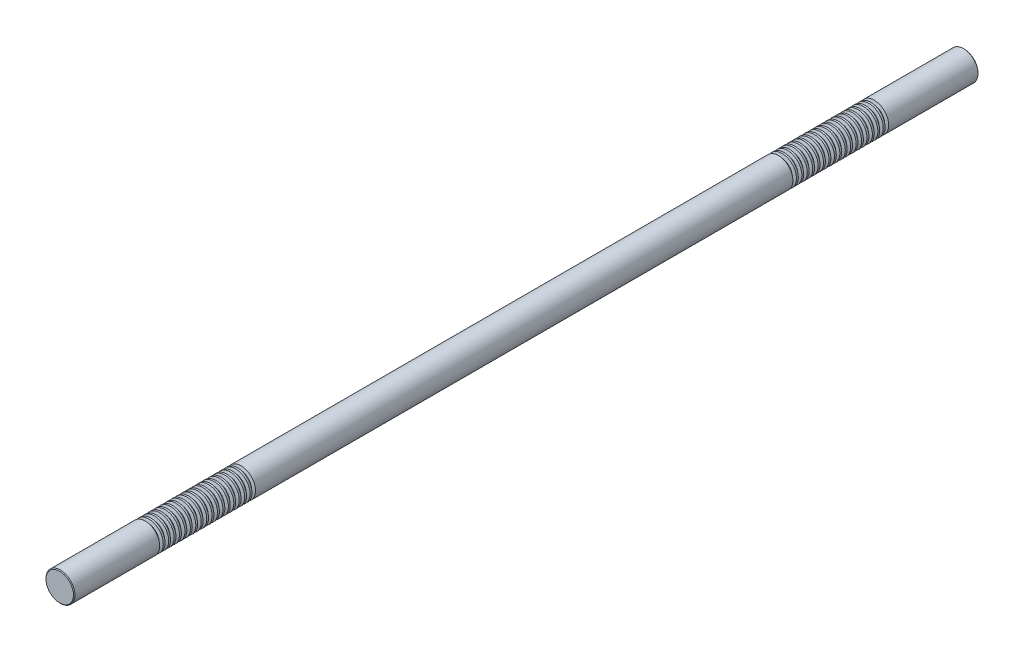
ISO-10303-21;
HEADER;
FILE_DESCRIPTION(('STEP AP214'),'2;1');
FILE_NAME('part.step','',(''),(''),'','','');
FILE_SCHEMA(('AUTOMOTIVE_DESIGN { 1 0 10303 214 1 1 1 1 }'));
ENDSEC;
DATA;
#1=APPLICATION_CONTEXT('core data for automotive mechanical design processes');
#2=APPLICATION_PROTOCOL_DEFINITION('international standard','automotive_design',2000,#1);
#3=PRODUCT_CONTEXT('',#1,'mechanical');
#4=PRODUCT('Part','Part','',(#3));
#5=PRODUCT_RELATED_PRODUCT_CATEGORY('part','',(#4));
#6=PRODUCT_DEFINITION_FORMATION('','',#4);
#7=PRODUCT_DEFINITION_CONTEXT('part definition',#1,'design');
#8=PRODUCT_DEFINITION('design','',#6,#7);
#9=PRODUCT_DEFINITION_SHAPE('','',#8);
#10=(LENGTH_UNIT() NAMED_UNIT(*) SI_UNIT(.MILLI.,.METRE.));
#11=(NAMED_UNIT(*) PLANE_ANGLE_UNIT() SI_UNIT($,.RADIAN.));
#12=(NAMED_UNIT(*) SI_UNIT($,.STERADIAN.) SOLID_ANGLE_UNIT());
#13=UNCERTAINTY_MEASURE_WITH_UNIT(LENGTH_MEASURE(1.E-05),#10,'distance_accuracy_value','');
#14=(GEOMETRIC_REPRESENTATION_CONTEXT(3) GLOBAL_UNCERTAINTY_ASSIGNED_CONTEXT((#13)) GLOBAL_UNIT_ASSIGNED_CONTEXT((#10,
#11,#12)) REPRESENTATION_CONTEXT('',''));
#15=CARTESIAN_POINT('',(0.,0.,0.));
#16=DIRECTION('',(0.,0.,1.));
#17=DIRECTION('',(1.,0.,0.));
#18=AXIS2_PLACEMENT_3D('',#15,#16,#17);
#19=CARTESIAN_POINT('',(0.,0.,500.));
#20=DIRECTION('',(0.,0.,-1.));
#21=DIRECTION('',(-1.,0.,0.));
#22=AXIS2_PLACEMENT_3D('',#19,#20,#21);
#23=CYLINDRICAL_SURFACE('',#22,16.);
#24=CARTESIAN_POINT('',(0.,0.,399.468911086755));
#25=DIRECTION('',(0.,0.,1.));
#26=DIRECTION('',(1.,0.,0.));
#27=AXIS2_PLACEMENT_3D('',#24,#25,#26);
#28=CIRCLE('',#27,16.);
#29=CARTESIAN_POINT('',(16.,0.,399.468911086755));
#30=VERTEX_POINT('',#29);
#31=EDGE_CURVE('E610',#30,#30,#28,.T.);
#32=ORIENTED_EDGE('',*,*,#31,.T.);
#33=EDGE_LOOP('',(#32));
#34=FACE_BOUND('',#33,.T.);
#35=CARTESIAN_POINT('',(0.,0.,401.531088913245));
#36=DIRECTION('',(0.,0.,1.));
#37=DIRECTION('',(1.,0.,0.));
#38=AXIS2_PLACEMENT_3D('',#35,#36,#37);
#39=CIRCLE('',#38,16.);
#40=CARTESIAN_POINT('',(16.,0.,401.531088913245));
#41=VERTEX_POINT('',#40);
#42=EDGE_CURVE('E622',#41,#41,#39,.T.);
#43=ORIENTED_EDGE('',*,*,#42,.F.);
#44=EDGE_LOOP('',(#43));
#45=FACE_BOUND('',#44,.T.);
#46=ADVANCED_FACE('F37',(#34,#45),#23,.T.);
#47=CARTESIAN_POINT('',(0.,0.,393.468911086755));
#48=DIRECTION('',(0.,0.,1.));
#49=DIRECTION('',(1.,0.,0.));
#50=AXIS2_PLACEMENT_3D('',#47,#48,#49);
#51=CIRCLE('',#50,16.);
#52=CARTESIAN_POINT('',(16.,0.,393.468911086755));
#53=VERTEX_POINT('',#52);
#54=EDGE_CURVE('E595',#53,#53,#51,.T.);
#55=ORIENTED_EDGE('',*,*,#54,.T.);
#56=EDGE_LOOP('',(#55));
#57=FACE_BOUND('',#56,.T.);
#58=CARTESIAN_POINT('',(0.,0.,395.531088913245));
#59=DIRECTION('',(0.,0.,1.));
#60=DIRECTION('',(1.,0.,0.));
#61=AXIS2_PLACEMENT_3D('',#58,#59,#60);
#62=CIRCLE('',#61,16.);
#63=CARTESIAN_POINT('',(16.,0.,395.531088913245));
#64=VERTEX_POINT('',#63);
#65=EDGE_CURVE('E607',#64,#64,#62,.T.);
#66=ORIENTED_EDGE('',*,*,#65,.F.);
#67=EDGE_LOOP('',(#66));
#68=FACE_BOUND('',#67,.T.);
#69=ADVANCED_FACE('F657',(#57,#68),#23,.T.);
#70=CARTESIAN_POINT('',(0.,0.,387.468911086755));
#71=DIRECTION('',(0.,0.,1.));
#72=DIRECTION('',(1.,0.,0.));
#73=AXIS2_PLACEMENT_3D('',#70,#71,#72);
#74=CIRCLE('',#73,16.);
#75=CARTESIAN_POINT('',(16.,0.,387.468911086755));
#76=VERTEX_POINT('',#75);
#77=EDGE_CURVE('E579',#76,#76,#74,.T.);
#78=ORIENTED_EDGE('',*,*,#77,.T.);
#79=EDGE_LOOP('',(#78));
#80=FACE_BOUND('',#79,.T.);
#81=CARTESIAN_POINT('',(0.,0.,389.531088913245));
#82=DIRECTION('',(0.,0.,1.));
#83=DIRECTION('',(1.,0.,0.));
#84=AXIS2_PLACEMENT_3D('',#81,#82,#83);
#85=CIRCLE('',#84,16.);
#86=CARTESIAN_POINT('',(16.,0.,389.531088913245));
#87=VERTEX_POINT('',#86);
#88=EDGE_CURVE('E591',#87,#87,#85,.T.);
#89=ORIENTED_EDGE('',*,*,#88,.F.);
#90=EDGE_LOOP('',(#89));
#91=FACE_BOUND('',#90,.T.);
#92=ADVANCED_FACE('F665',(#80,#91),#23,.T.);
#93=CARTESIAN_POINT('',(0.,0.,381.468911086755));
#94=DIRECTION('',(0.,0.,1.));
#95=DIRECTION('',(1.,0.,0.));
#96=AXIS2_PLACEMENT_3D('',#93,#94,#95);
#97=CIRCLE('',#96,16.);
#98=CARTESIAN_POINT('',(16.,0.,381.468911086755));
#99=VERTEX_POINT('',#98);
#100=EDGE_CURVE('E563',#99,#99,#97,.T.);
#101=ORIENTED_EDGE('',*,*,#100,.T.);
#102=EDGE_LOOP('',(#101));
#103=FACE_BOUND('',#102,.T.);
#104=CARTESIAN_POINT('',(0.,0.,383.531088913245));
#105=DIRECTION('',(0.,0.,1.));
#106=DIRECTION('',(1.,0.,0.));
#107=AXIS2_PLACEMENT_3D('',#104,#105,#106);
#108=CIRCLE('',#107,16.);
#109=CARTESIAN_POINT('',(16.,0.,383.531088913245));
#110=VERTEX_POINT('',#109);
#111=EDGE_CURVE('E575',#110,#110,#108,.T.);
#112=ORIENTED_EDGE('',*,*,#111,.F.);
#113=EDGE_LOOP('',(#112));
#114=FACE_BOUND('',#113,.T.);
#115=ADVANCED_FACE('F1394',(#103,#114),#23,.T.);
#116=CARTESIAN_POINT('',(0.,0.,375.468911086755));
#117=DIRECTION('',(0.,0.,1.));
#118=DIRECTION('',(1.,0.,0.));
#119=AXIS2_PLACEMENT_3D('',#116,#117,#118);
#120=CIRCLE('',#119,16.);
#121=CARTESIAN_POINT('',(16.,0.,375.468911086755));
#122=VERTEX_POINT('',#121);
#123=EDGE_CURVE('E547',#122,#122,#120,.T.);
#124=ORIENTED_EDGE('',*,*,#123,.T.);
#125=EDGE_LOOP('',(#124));
#126=FACE_BOUND('',#125,.T.);
#127=CARTESIAN_POINT('',(0.,0.,377.531088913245));
#128=DIRECTION('',(0.,0.,1.));
#129=DIRECTION('',(1.,0.,0.));
#130=AXIS2_PLACEMENT_3D('',#127,#128,#129);
#131=CIRCLE('',#130,16.);
#132=CARTESIAN_POINT('',(16.,0.,377.531088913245));
#133=VERTEX_POINT('',#132);
#134=EDGE_CURVE('E559',#133,#133,#131,.T.);
#135=ORIENTED_EDGE('',*,*,#134,.F.);
#136=EDGE_LOOP('',(#135));
#137=FACE_BOUND('',#136,.T.);
#138=ADVANCED_FACE('F1371',(#126,#137),#23,.T.);
#139=CARTESIAN_POINT('',(0.,0.,369.468911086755));
#140=DIRECTION('',(0.,0.,1.));
#141=DIRECTION('',(1.,0.,0.));
#142=AXIS2_PLACEMENT_3D('',#139,#140,#141);
#143=CIRCLE('',#142,16.);
#144=CARTESIAN_POINT('',(16.,0.,369.468911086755));
#145=VERTEX_POINT('',#144);
#146=EDGE_CURVE('E531',#145,#145,#143,.T.);
#147=ORIENTED_EDGE('',*,*,#146,.T.);
#148=EDGE_LOOP('',(#147));
#149=FACE_BOUND('',#148,.T.);
#150=CARTESIAN_POINT('',(0.,0.,371.531088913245));
#151=DIRECTION('',(0.,0.,1.));
#152=DIRECTION('',(1.,0.,0.));
#153=AXIS2_PLACEMENT_3D('',#150,#151,#152);
#154=CIRCLE('',#153,16.);
#155=CARTESIAN_POINT('',(16.,0.,371.531088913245));
#156=VERTEX_POINT('',#155);
#157=EDGE_CURVE('E543',#156,#156,#154,.T.);
#158=ORIENTED_EDGE('',*,*,#157,.F.);
#159=EDGE_LOOP('',(#158));
#160=FACE_BOUND('',#159,.T.);
#161=ADVANCED_FACE('F1348',(#149,#160),#23,.T.);
#162=CARTESIAN_POINT('',(0.,0.,363.468911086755));
#163=DIRECTION('',(0.,0.,1.));
#164=DIRECTION('',(1.,0.,0.));
#165=AXIS2_PLACEMENT_3D('',#162,#163,#164);
#166=CIRCLE('',#165,16.);
#167=CARTESIAN_POINT('',(16.,0.,363.468911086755));
#168=VERTEX_POINT('',#167);
#169=EDGE_CURVE('E515',#168,#168,#166,.T.);
#170=ORIENTED_EDGE('',*,*,#169,.T.);
#171=EDGE_LOOP('',(#170));
#172=FACE_BOUND('',#171,.T.);
#173=CARTESIAN_POINT('',(0.,0.,365.531088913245));
#174=DIRECTION('',(0.,0.,1.));
#175=DIRECTION('',(1.,0.,0.));
#176=AXIS2_PLACEMENT_3D('',#173,#174,#175);
#177=CIRCLE('',#176,16.);
#178=CARTESIAN_POINT('',(16.,0.,365.531088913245));
#179=VERTEX_POINT('',#178);
#180=EDGE_CURVE('E527',#179,#179,#177,.T.);
#181=ORIENTED_EDGE('',*,*,#180,.F.);
#182=EDGE_LOOP('',(#181));
#183=FACE_BOUND('',#182,.T.);
#184=ADVANCED_FACE('F1325',(#172,#183),#23,.T.);
#185=CARTESIAN_POINT('',(0.,0.,357.468911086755));
#186=DIRECTION('',(0.,0.,1.));
#187=DIRECTION('',(1.,0.,0.));
#188=AXIS2_PLACEMENT_3D('',#185,#186,#187);
#189=CIRCLE('',#188,16.);
#190=CARTESIAN_POINT('',(16.,0.,357.468911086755));
#191=VERTEX_POINT('',#190);
#192=EDGE_CURVE('E499',#191,#191,#189,.T.);
#193=ORIENTED_EDGE('',*,*,#192,.T.);
#194=EDGE_LOOP('',(#193));
#195=FACE_BOUND('',#194,.T.);
#196=CARTESIAN_POINT('',(0.,0.,359.531088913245));
#197=DIRECTION('',(0.,0.,1.));
#198=DIRECTION('',(1.,0.,0.));
#199=AXIS2_PLACEMENT_3D('',#196,#197,#198);
#200=CIRCLE('',#199,16.);
#201=CARTESIAN_POINT('',(16.,0.,359.531088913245));
#202=VERTEX_POINT('',#201);
#203=EDGE_CURVE('E511',#202,#202,#200,.T.);
#204=ORIENTED_EDGE('',*,*,#203,.F.);
#205=EDGE_LOOP('',(#204));
#206=FACE_BOUND('',#205,.T.);
#207=ADVANCED_FACE('F1302',(#195,#206),#23,.T.);
#208=CARTESIAN_POINT('',(0.,0.,351.468911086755));
#209=DIRECTION('',(0.,0.,1.));
#210=DIRECTION('',(1.,0.,0.));
#211=AXIS2_PLACEMENT_3D('',#208,#209,#210);
#212=CIRCLE('',#211,16.);
#213=CARTESIAN_POINT('',(16.,0.,351.468911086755));
#214=VERTEX_POINT('',#213);
#215=EDGE_CURVE('E483',#214,#214,#212,.T.);
#216=ORIENTED_EDGE('',*,*,#215,.T.);
#217=EDGE_LOOP('',(#216));
#218=FACE_BOUND('',#217,.T.);
#219=CARTESIAN_POINT('',(0.,0.,353.531088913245));
#220=DIRECTION('',(0.,0.,1.));
#221=DIRECTION('',(1.,0.,0.));
#222=AXIS2_PLACEMENT_3D('',#219,#220,#221);
#223=CIRCLE('',#222,16.);
#224=CARTESIAN_POINT('',(16.,0.,353.531088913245));
#225=VERTEX_POINT('',#224);
#226=EDGE_CURVE('E495',#225,#225,#223,.T.);
#227=ORIENTED_EDGE('',*,*,#226,.F.);
#228=EDGE_LOOP('',(#227));
#229=FACE_BOUND('',#228,.T.);
#230=ADVANCED_FACE('F1279',(#218,#229),#23,.T.);
#231=CARTESIAN_POINT('',(0.,0.,345.468911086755));
#232=DIRECTION('',(0.,0.,1.));
#233=DIRECTION('',(1.,0.,0.));
#234=AXIS2_PLACEMENT_3D('',#231,#232,#233);
#235=CIRCLE('',#234,16.);
#236=CARTESIAN_POINT('',(16.,0.,345.468911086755));
#237=VERTEX_POINT('',#236);
#238=EDGE_CURVE('E467',#237,#237,#235,.T.);
#239=ORIENTED_EDGE('',*,*,#238,.T.);
#240=EDGE_LOOP('',(#239));
#241=FACE_BOUND('',#240,.T.);
#242=CARTESIAN_POINT('',(0.,0.,347.531088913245));
#243=DIRECTION('',(0.,0.,1.));
#244=DIRECTION('',(1.,0.,0.));
#245=AXIS2_PLACEMENT_3D('',#242,#243,#244);
#246=CIRCLE('',#245,16.);
#247=CARTESIAN_POINT('',(16.,0.,347.531088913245));
#248=VERTEX_POINT('',#247);
#249=EDGE_CURVE('E479',#248,#248,#246,.T.);
#250=ORIENTED_EDGE('',*,*,#249,.F.);
#251=EDGE_LOOP('',(#250));
#252=FACE_BOUND('',#251,.T.);
#253=ADVANCED_FACE('F1256',(#241,#252),#23,.T.);
#254=CARTESIAN_POINT('',(0.,0.,339.468911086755));
#255=DIRECTION('',(0.,0.,1.));
#256=DIRECTION('',(1.,0.,0.));
#257=AXIS2_PLACEMENT_3D('',#254,#255,#256);
#258=CIRCLE('',#257,16.);
#259=CARTESIAN_POINT('',(16.,0.,339.468911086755));
#260=VERTEX_POINT('',#259);
#261=EDGE_CURVE('E451',#260,#260,#258,.T.);
#262=ORIENTED_EDGE('',*,*,#261,.T.);
#263=EDGE_LOOP('',(#262));
#264=FACE_BOUND('',#263,.T.);
#265=CARTESIAN_POINT('',(0.,0.,341.531088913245));
#266=DIRECTION('',(0.,0.,1.));
#267=DIRECTION('',(1.,0.,0.));
#268=AXIS2_PLACEMENT_3D('',#265,#266,#267);
#269=CIRCLE('',#268,16.);
#270=CARTESIAN_POINT('',(16.,0.,341.531088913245));
#271=VERTEX_POINT('',#270);
#272=EDGE_CURVE('E463',#271,#271,#269,.T.);
#273=ORIENTED_EDGE('',*,*,#272,.F.);
#274=EDGE_LOOP('',(#273));
#275=FACE_BOUND('',#274,.T.);
#276=ADVANCED_FACE('F1233',(#264,#275),#23,.T.);
#277=CARTESIAN_POINT('',(0.,0.,333.468911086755));
#278=DIRECTION('',(0.,0.,1.));
#279=DIRECTION('',(1.,0.,0.));
#280=AXIS2_PLACEMENT_3D('',#277,#278,#279);
#281=CIRCLE('',#280,16.);
#282=CARTESIAN_POINT('',(16.,0.,333.468911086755));
#283=VERTEX_POINT('',#282);
#284=EDGE_CURVE('E435',#283,#283,#281,.T.);
#285=ORIENTED_EDGE('',*,*,#284,.T.);
#286=EDGE_LOOP('',(#285));
#287=FACE_BOUND('',#286,.T.);
#288=CARTESIAN_POINT('',(0.,0.,335.531088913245));
#289=DIRECTION('',(0.,0.,1.));
#290=DIRECTION('',(1.,0.,0.));
#291=AXIS2_PLACEMENT_3D('',#288,#289,#290);
#292=CIRCLE('',#291,16.);
#293=CARTESIAN_POINT('',(16.,0.,335.531088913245));
#294=VERTEX_POINT('',#293);
#295=EDGE_CURVE('E447',#294,#294,#292,.T.);
#296=ORIENTED_EDGE('',*,*,#295,.F.);
#297=EDGE_LOOP('',(#296));
#298=FACE_BOUND('',#297,.T.);
#299=ADVANCED_FACE('F1210',(#287,#298),#23,.T.);
#300=CARTESIAN_POINT('',(0.,0.,327.468911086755));
#301=DIRECTION('',(0.,0.,1.));
#302=DIRECTION('',(1.,0.,0.));
#303=AXIS2_PLACEMENT_3D('',#300,#301,#302);
#304=CIRCLE('',#303,16.);
#305=CARTESIAN_POINT('',(16.,0.,327.468911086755));
#306=VERTEX_POINT('',#305);
#307=EDGE_CURVE('E419',#306,#306,#304,.T.);
#308=ORIENTED_EDGE('',*,*,#307,.T.);
#309=EDGE_LOOP('',(#308));
#310=FACE_BOUND('',#309,.T.);
#311=CARTESIAN_POINT('',(0.,0.,329.531088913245));
#312=DIRECTION('',(0.,0.,1.));
#313=DIRECTION('',(1.,0.,0.));
#314=AXIS2_PLACEMENT_3D('',#311,#312,#313);
#315=CIRCLE('',#314,16.);
#316=CARTESIAN_POINT('',(16.,0.,329.531088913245));
#317=VERTEX_POINT('',#316);
#318=EDGE_CURVE('E431',#317,#317,#315,.T.);
#319=ORIENTED_EDGE('',*,*,#318,.F.);
#320=EDGE_LOOP('',(#319));
#321=FACE_BOUND('',#320,.T.);
#322=ADVANCED_FACE('F1187',(#310,#321),#23,.T.);
#323=CARTESIAN_POINT('',(0.,0.,321.468911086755));
#324=DIRECTION('',(0.,0.,1.));
#325=DIRECTION('',(1.,0.,0.));
#326=AXIS2_PLACEMENT_3D('',#323,#324,#325);
#327=CIRCLE('',#326,16.);
#328=CARTESIAN_POINT('',(16.,0.,321.468911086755));
#329=VERTEX_POINT('',#328);
#330=EDGE_CURVE('E403',#329,#329,#327,.T.);
#331=ORIENTED_EDGE('',*,*,#330,.T.);
#332=EDGE_LOOP('',(#331));
#333=FACE_BOUND('',#332,.T.);
#334=CARTESIAN_POINT('',(0.,0.,323.531088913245));
#335=DIRECTION('',(0.,0.,1.));
#336=DIRECTION('',(1.,0.,0.));
#337=AXIS2_PLACEMENT_3D('',#334,#335,#336);
#338=CIRCLE('',#337,16.);
#339=CARTESIAN_POINT('',(16.,0.,323.531088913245));
#340=VERTEX_POINT('',#339);
#341=EDGE_CURVE('E415',#340,#340,#338,.T.);
#342=ORIENTED_EDGE('',*,*,#341,.F.);
#343=EDGE_LOOP('',(#342));
#344=FACE_BOUND('',#343,.T.);
#345=ADVANCED_FACE('F1164',(#333,#344),#23,.T.);
#346=CARTESIAN_POINT('',(0.,0.,315.468911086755));
#347=DIRECTION('',(0.,0.,1.));
#348=DIRECTION('',(1.,0.,0.));
#349=AXIS2_PLACEMENT_3D('',#346,#347,#348);
#350=CIRCLE('',#349,16.);
#351=CARTESIAN_POINT('',(16.,0.,315.468911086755));
#352=VERTEX_POINT('',#351);
#353=EDGE_CURVE('E387',#352,#352,#350,.T.);
#354=ORIENTED_EDGE('',*,*,#353,.T.);
#355=EDGE_LOOP('',(#354));
#356=FACE_BOUND('',#355,.T.);
#357=CARTESIAN_POINT('',(0.,0.,317.531088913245));
#358=DIRECTION('',(0.,0.,1.));
#359=DIRECTION('',(1.,0.,0.));
#360=AXIS2_PLACEMENT_3D('',#357,#358,#359);
#361=CIRCLE('',#360,16.);
#362=CARTESIAN_POINT('',(16.,0.,317.531088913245));
#363=VERTEX_POINT('',#362);
#364=EDGE_CURVE('E399',#363,#363,#361,.T.);
#365=ORIENTED_EDGE('',*,*,#364,.F.);
#366=EDGE_LOOP('',(#365));
#367=FACE_BOUND('',#366,.T.);
#368=ADVANCED_FACE('F1141',(#356,#367),#23,.T.);
#369=CARTESIAN_POINT('',(0.,0.,309.468911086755));
#370=DIRECTION('',(0.,0.,1.));
#371=DIRECTION('',(1.,0.,0.));
#372=AXIS2_PLACEMENT_3D('',#369,#370,#371);
#373=CIRCLE('',#372,16.);
#374=CARTESIAN_POINT('',(16.,0.,309.468911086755));
#375=VERTEX_POINT('',#374);
#376=EDGE_CURVE('E371',#375,#375,#373,.T.);
#377=ORIENTED_EDGE('',*,*,#376,.T.);
#378=EDGE_LOOP('',(#377));
#379=FACE_BOUND('',#378,.T.);
#380=CARTESIAN_POINT('',(0.,0.,311.531088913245));
#381=DIRECTION('',(0.,0.,1.));
#382=DIRECTION('',(1.,0.,0.));
#383=AXIS2_PLACEMENT_3D('',#380,#381,#382);
#384=CIRCLE('',#383,16.);
#385=CARTESIAN_POINT('',(16.,0.,311.531088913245));
#386=VERTEX_POINT('',#385);
#387=EDGE_CURVE('E383',#386,#386,#384,.T.);
#388=ORIENTED_EDGE('',*,*,#387,.F.);
#389=EDGE_LOOP('',(#388));
#390=FACE_BOUND('',#389,.T.);
#391=ADVANCED_FACE('F1118',(#379,#390),#23,.T.);
#392=CARTESIAN_POINT('',(0.,0.,303.468911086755));
#393=DIRECTION('',(0.,0.,1.));
#394=DIRECTION('',(1.,0.,0.));
#395=AXIS2_PLACEMENT_3D('',#392,#393,#394);
#396=CIRCLE('',#395,16.);
#397=CARTESIAN_POINT('',(16.,0.,303.468911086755));
#398=VERTEX_POINT('',#397);
#399=EDGE_CURVE('E355',#398,#398,#396,.T.);
#400=ORIENTED_EDGE('',*,*,#399,.T.);
#401=EDGE_LOOP('',(#400));
#402=FACE_BOUND('',#401,.T.);
#403=CARTESIAN_POINT('',(0.,0.,305.531088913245));
#404=DIRECTION('',(0.,0.,1.));
#405=DIRECTION('',(1.,0.,0.));
#406=AXIS2_PLACEMENT_3D('',#403,#404,#405);
#407=CIRCLE('',#406,16.);
#408=CARTESIAN_POINT('',(16.,0.,305.531088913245));
#409=VERTEX_POINT('',#408);
#410=EDGE_CURVE('E367',#409,#409,#407,.T.);
#411=ORIENTED_EDGE('',*,*,#410,.F.);
#412=EDGE_LOOP('',(#411));
#413=FACE_BOUND('',#412,.T.);
#414=ADVANCED_FACE('F1095',(#402,#413),#23,.T.);
#415=CARTESIAN_POINT('',(0.,0.,-294.531088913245));
#416=DIRECTION('',(0.,0.,1.));
#417=DIRECTION('',(1.,0.,0.));
#418=AXIS2_PLACEMENT_3D('',#415,#416,#417);
#419=CIRCLE('',#418,16.);
#420=CARTESIAN_POINT('',(16.,0.,-294.531088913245));
#421=VERTEX_POINT('',#420);
#422=EDGE_CURVE('E339',#421,#421,#419,.T.);
#423=ORIENTED_EDGE('',*,*,#422,.T.);
#424=EDGE_LOOP('',(#423));
#425=FACE_BOUND('',#424,.T.);
#426=CARTESIAN_POINT('',(0.,0.,299.531088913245));
#427=DIRECTION('',(0.,0.,1.));
#428=DIRECTION('',(1.,0.,0.));
#429=AXIS2_PLACEMENT_3D('',#426,#427,#428);
#430=CIRCLE('',#429,16.);
#431=CARTESIAN_POINT('',(16.,0.,299.531088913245));
#432=VERTEX_POINT('',#431);
#433=EDGE_CURVE('E351',#432,#432,#430,.T.);
#434=ORIENTED_EDGE('',*,*,#433,.F.);
#435=EDGE_LOOP('',(#434));
#436=FACE_BOUND('',#435,.T.);
#437=ADVANCED_FACE('F1072',(#425,#436),#23,.T.);
#438=CARTESIAN_POINT('',(0.,0.,-300.531088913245));
#439=DIRECTION('',(0.,0.,1.));
#440=DIRECTION('',(1.,0.,0.));
#441=AXIS2_PLACEMENT_3D('',#438,#439,#440);
#442=CIRCLE('',#441,16.);
#443=CARTESIAN_POINT('',(16.,0.,-300.531088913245));
#444=VERTEX_POINT('',#443);
#445=EDGE_CURVE('E323',#444,#444,#442,.T.);
#446=ORIENTED_EDGE('',*,*,#445,.T.);
#447=EDGE_LOOP('',(#446));
#448=FACE_BOUND('',#447,.T.);
#449=CARTESIAN_POINT('',(0.,0.,-298.468911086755));
#450=DIRECTION('',(0.,0.,1.));
#451=DIRECTION('',(1.,0.,0.));
#452=AXIS2_PLACEMENT_3D('',#449,#450,#451);
#453=CIRCLE('',#452,16.);
#454=CARTESIAN_POINT('',(16.,0.,-298.468911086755));
#455=VERTEX_POINT('',#454);
#456=EDGE_CURVE('E335',#455,#455,#453,.T.);
#457=ORIENTED_EDGE('',*,*,#456,.F.);
#458=EDGE_LOOP('',(#457));
#459=FACE_BOUND('',#458,.T.);
#460=ADVANCED_FACE('F1049',(#448,#459),#23,.T.);
#461=CARTESIAN_POINT('',(0.,0.,-306.531088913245));
#462=DIRECTION('',(0.,0.,1.));
#463=DIRECTION('',(1.,0.,0.));
#464=AXIS2_PLACEMENT_3D('',#461,#462,#463);
#465=CIRCLE('',#464,16.);
#466=CARTESIAN_POINT('',(16.,0.,-306.531088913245));
#467=VERTEX_POINT('',#466);
#468=EDGE_CURVE('E307',#467,#467,#465,.T.);
#469=ORIENTED_EDGE('',*,*,#468,.T.);
#470=EDGE_LOOP('',(#469));
#471=FACE_BOUND('',#470,.T.);
#472=CARTESIAN_POINT('',(0.,0.,-304.468911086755));
#473=DIRECTION('',(0.,0.,1.));
#474=DIRECTION('',(1.,0.,0.));
#475=AXIS2_PLACEMENT_3D('',#472,#473,#474);
#476=CIRCLE('',#475,16.);
#477=CARTESIAN_POINT('',(16.,0.,-304.468911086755));
#478=VERTEX_POINT('',#477);
#479=EDGE_CURVE('E319',#478,#478,#476,.T.);
#480=ORIENTED_EDGE('',*,*,#479,.F.);
#481=EDGE_LOOP('',(#480));
#482=FACE_BOUND('',#481,.T.);
#483=ADVANCED_FACE('F1026',(#471,#482),#23,.T.);
#484=CARTESIAN_POINT('',(0.,0.,-312.531088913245));
#485=DIRECTION('',(0.,0.,1.));
#486=DIRECTION('',(1.,0.,0.));
#487=AXIS2_PLACEMENT_3D('',#484,#485,#486);
#488=CIRCLE('',#487,16.);
#489=CARTESIAN_POINT('',(16.,0.,-312.531088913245));
#490=VERTEX_POINT('',#489);
#491=EDGE_CURVE('E291',#490,#490,#488,.T.);
#492=ORIENTED_EDGE('',*,*,#491,.T.);
#493=EDGE_LOOP('',(#492));
#494=FACE_BOUND('',#493,.T.);
#495=CARTESIAN_POINT('',(0.,0.,-310.468911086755));
#496=DIRECTION('',(0.,0.,1.));
#497=DIRECTION('',(1.,0.,0.));
#498=AXIS2_PLACEMENT_3D('',#495,#496,#497);
#499=CIRCLE('',#498,16.);
#500=CARTESIAN_POINT('',(16.,0.,-310.468911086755));
#501=VERTEX_POINT('',#500);
#502=EDGE_CURVE('E303',#501,#501,#499,.T.);
#503=ORIENTED_EDGE('',*,*,#502,.F.);
#504=EDGE_LOOP('',(#503));
#505=FACE_BOUND('',#504,.T.);
#506=ADVANCED_FACE('F1003',(#494,#505),#23,.T.);
#507=CARTESIAN_POINT('',(0.,0.,-318.531088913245));
#508=DIRECTION('',(0.,0.,1.));
#509=DIRECTION('',(1.,0.,0.));
#510=AXIS2_PLACEMENT_3D('',#507,#508,#509);
#511=CIRCLE('',#510,16.);
#512=CARTESIAN_POINT('',(16.,0.,-318.531088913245));
#513=VERTEX_POINT('',#512);
#514=EDGE_CURVE('E275',#513,#513,#511,.T.);
#515=ORIENTED_EDGE('',*,*,#514,.T.);
#516=EDGE_LOOP('',(#515));
#517=FACE_BOUND('',#516,.T.);
#518=CARTESIAN_POINT('',(0.,0.,-316.468911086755));
#519=DIRECTION('',(0.,0.,1.));
#520=DIRECTION('',(1.,0.,0.));
#521=AXIS2_PLACEMENT_3D('',#518,#519,#520);
#522=CIRCLE('',#521,16.);
#523=CARTESIAN_POINT('',(16.,0.,-316.468911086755));
#524=VERTEX_POINT('',#523);
#525=EDGE_CURVE('E287',#524,#524,#522,.T.);
#526=ORIENTED_EDGE('',*,*,#525,.F.);
#527=EDGE_LOOP('',(#526));
#528=FACE_BOUND('',#527,.T.);
#529=ADVANCED_FACE('F980',(#517,#528),#23,.T.);
#530=CARTESIAN_POINT('',(0.,0.,-324.531088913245));
#531=DIRECTION('',(0.,0.,1.));
#532=DIRECTION('',(1.,0.,0.));
#533=AXIS2_PLACEMENT_3D('',#530,#531,#532);
#534=CIRCLE('',#533,16.);
#535=CARTESIAN_POINT('',(16.,0.,-324.531088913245));
#536=VERTEX_POINT('',#535);
#537=EDGE_CURVE('E259',#536,#536,#534,.T.);
#538=ORIENTED_EDGE('',*,*,#537,.T.);
#539=EDGE_LOOP('',(#538));
#540=FACE_BOUND('',#539,.T.);
#541=CARTESIAN_POINT('',(0.,0.,-322.468911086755));
#542=DIRECTION('',(0.,0.,1.));
#543=DIRECTION('',(1.,0.,0.));
#544=AXIS2_PLACEMENT_3D('',#541,#542,#543);
#545=CIRCLE('',#544,16.);
#546=CARTESIAN_POINT('',(16.,0.,-322.468911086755));
#547=VERTEX_POINT('',#546);
#548=EDGE_CURVE('E271',#547,#547,#545,.T.);
#549=ORIENTED_EDGE('',*,*,#548,.F.);
#550=EDGE_LOOP('',(#549));
#551=FACE_BOUND('',#550,.T.);
#552=ADVANCED_FACE('F957',(#540,#551),#23,.T.);
#553=CARTESIAN_POINT('',(0.,0.,-330.531088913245));
#554=DIRECTION('',(0.,0.,1.));
#555=DIRECTION('',(1.,0.,0.));
#556=AXIS2_PLACEMENT_3D('',#553,#554,#555);
#557=CIRCLE('',#556,16.);
#558=CARTESIAN_POINT('',(16.,0.,-330.531088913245));
#559=VERTEX_POINT('',#558);
#560=EDGE_CURVE('E244',#559,#559,#557,.T.);
#561=ORIENTED_EDGE('',*,*,#560,.T.);
#562=EDGE_LOOP('',(#561));
#563=FACE_BOUND('',#562,.T.);
#564=CARTESIAN_POINT('',(0.,0.,-328.468911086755));
#565=DIRECTION('',(0.,0.,1.));
#566=DIRECTION('',(1.,0.,0.));
#567=AXIS2_PLACEMENT_3D('',#564,#565,#566);
#568=CIRCLE('',#567,16.);
#569=CARTESIAN_POINT('',(16.,0.,-328.468911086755));
#570=VERTEX_POINT('',#569);
#571=EDGE_CURVE('E255',#570,#570,#568,.T.);
#572=ORIENTED_EDGE('',*,*,#571,.F.);
#573=EDGE_LOOP('',(#572));
#574=FACE_BOUND('',#573,.T.);
#575=ADVANCED_FACE('F934',(#563,#574),#23,.T.);
#576=CARTESIAN_POINT('',(0.,0.,-336.531088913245));
#577=DIRECTION('',(0.,0.,1.));
#578=DIRECTION('',(1.,0.,0.));
#579=AXIS2_PLACEMENT_3D('',#576,#577,#578);
#580=CIRCLE('',#579,16.);
#581=CARTESIAN_POINT('',(16.,0.,-336.531088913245));
#582=VERTEX_POINT('',#581);
#583=EDGE_CURVE('E228',#582,#582,#580,.T.);
#584=ORIENTED_EDGE('',*,*,#583,.T.);
#585=EDGE_LOOP('',(#584));
#586=FACE_BOUND('',#585,.T.);
#587=CARTESIAN_POINT('',(0.,0.,-334.468911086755));
#588=DIRECTION('',(0.,0.,1.));
#589=DIRECTION('',(1.,0.,0.));
#590=AXIS2_PLACEMENT_3D('',#587,#588,#589);
#591=CIRCLE('',#590,16.);
#592=CARTESIAN_POINT('',(16.,0.,-334.468911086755));
#593=VERTEX_POINT('',#592);
#594=EDGE_CURVE('E240',#593,#593,#591,.T.);
#595=ORIENTED_EDGE('',*,*,#594,.F.);
#596=EDGE_LOOP('',(#595));
#597=FACE_BOUND('',#596,.T.);
#598=ADVANCED_FACE('F911',(#586,#597),#23,.T.);
#599=CARTESIAN_POINT('',(0.,0.,-342.531088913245));
#600=DIRECTION('',(0.,0.,1.));
#601=DIRECTION('',(1.,0.,0.));
#602=AXIS2_PLACEMENT_3D('',#599,#600,#601);
#603=CIRCLE('',#602,16.);
#604=CARTESIAN_POINT('',(16.,0.,-342.531088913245));
#605=VERTEX_POINT('',#604);
#606=EDGE_CURVE('E212',#605,#605,#603,.T.);
#607=ORIENTED_EDGE('',*,*,#606,.T.);
#608=EDGE_LOOP('',(#607));
#609=FACE_BOUND('',#608,.T.);
#610=CARTESIAN_POINT('',(0.,0.,-340.468911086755));
#611=DIRECTION('',(0.,0.,1.));
#612=DIRECTION('',(1.,0.,0.));
#613=AXIS2_PLACEMENT_3D('',#610,#611,#612);
#614=CIRCLE('',#613,16.);
#615=CARTESIAN_POINT('',(16.,0.,-340.468911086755));
#616=VERTEX_POINT('',#615);
#617=EDGE_CURVE('E224',#616,#616,#614,.T.);
#618=ORIENTED_EDGE('',*,*,#617,.F.);
#619=EDGE_LOOP('',(#618));
#620=FACE_BOUND('',#619,.T.);
#621=ADVANCED_FACE('F888',(#609,#620),#23,.T.);
#622=CARTESIAN_POINT('',(0.,0.,-348.531088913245));
#623=DIRECTION('',(0.,0.,1.));
#624=DIRECTION('',(1.,0.,0.));
#625=AXIS2_PLACEMENT_3D('',#622,#623,#624);
#626=CIRCLE('',#625,16.);
#627=CARTESIAN_POINT('',(16.,0.,-348.531088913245));
#628=VERTEX_POINT('',#627);
#629=EDGE_CURVE('E196',#628,#628,#626,.T.);
#630=ORIENTED_EDGE('',*,*,#629,.T.);
#631=EDGE_LOOP('',(#630));
#632=FACE_BOUND('',#631,.T.);
#633=CARTESIAN_POINT('',(0.,0.,-346.468911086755));
#634=DIRECTION('',(0.,0.,1.));
#635=DIRECTION('',(1.,0.,0.));
#636=AXIS2_PLACEMENT_3D('',#633,#634,#635);
#637=CIRCLE('',#636,16.);
#638=CARTESIAN_POINT('',(16.,0.,-346.468911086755));
#639=VERTEX_POINT('',#638);
#640=EDGE_CURVE('E208',#639,#639,#637,.T.);
#641=ORIENTED_EDGE('',*,*,#640,.F.);
#642=EDGE_LOOP('',(#641));
#643=FACE_BOUND('',#642,.T.);
#644=ADVANCED_FACE('F865',(#632,#643),#23,.T.);
#645=CARTESIAN_POINT('',(0.,0.,-354.531088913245));
#646=DIRECTION('',(0.,0.,1.));
#647=DIRECTION('',(1.,0.,0.));
#648=AXIS2_PLACEMENT_3D('',#645,#646,#647);
#649=CIRCLE('',#648,16.);
#650=CARTESIAN_POINT('',(16.,0.,-354.531088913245));
#651=VERTEX_POINT('',#650);
#652=EDGE_CURVE('E180',#651,#651,#649,.T.);
#653=ORIENTED_EDGE('',*,*,#652,.T.);
#654=EDGE_LOOP('',(#653));
#655=FACE_BOUND('',#654,.T.);
#656=CARTESIAN_POINT('',(0.,0.,-352.468911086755));
#657=DIRECTION('',(0.,0.,1.));
#658=DIRECTION('',(1.,0.,0.));
#659=AXIS2_PLACEMENT_3D('',#656,#657,#658);
#660=CIRCLE('',#659,16.);
#661=CARTESIAN_POINT('',(16.,0.,-352.468911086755));
#662=VERTEX_POINT('',#661);
#663=EDGE_CURVE('E192',#662,#662,#660,.T.);
#664=ORIENTED_EDGE('',*,*,#663,.F.);
#665=EDGE_LOOP('',(#664));
#666=FACE_BOUND('',#665,.T.);
#667=ADVANCED_FACE('F842',(#655,#666),#23,.T.);
#668=CARTESIAN_POINT('',(0.,0.,-360.531088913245));
#669=DIRECTION('',(0.,0.,1.));
#670=DIRECTION('',(1.,0.,0.));
#671=AXIS2_PLACEMENT_3D('',#668,#669,#670);
#672=CIRCLE('',#671,16.);
#673=CARTESIAN_POINT('',(16.,0.,-360.531088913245));
#674=VERTEX_POINT('',#673);
#675=EDGE_CURVE('E164',#674,#674,#672,.T.);
#676=ORIENTED_EDGE('',*,*,#675,.T.);
#677=EDGE_LOOP('',(#676));
#678=FACE_BOUND('',#677,.T.);
#679=CARTESIAN_POINT('',(0.,0.,-358.468911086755));
#680=DIRECTION('',(0.,0.,1.));
#681=DIRECTION('',(1.,0.,0.));
#682=AXIS2_PLACEMENT_3D('',#679,#680,#681);
#683=CIRCLE('',#682,16.);
#684=CARTESIAN_POINT('',(16.,0.,-358.468911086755));
#685=VERTEX_POINT('',#684);
#686=EDGE_CURVE('E176',#685,#685,#683,.T.);
#687=ORIENTED_EDGE('',*,*,#686,.F.);
#688=EDGE_LOOP('',(#687));
#689=FACE_BOUND('',#688,.T.);
#690=ADVANCED_FACE('F819',(#678,#689),#23,.T.);
#691=CARTESIAN_POINT('',(0.,0.,-366.531088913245));
#692=DIRECTION('',(0.,0.,1.));
#693=DIRECTION('',(1.,0.,0.));
#694=AXIS2_PLACEMENT_3D('',#691,#692,#693);
#695=CIRCLE('',#694,16.);
#696=CARTESIAN_POINT('',(16.,0.,-366.531088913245));
#697=VERTEX_POINT('',#696);
#698=EDGE_CURVE('E149',#697,#697,#695,.T.);
#699=ORIENTED_EDGE('',*,*,#698,.T.);
#700=EDGE_LOOP('',(#699));
#701=FACE_BOUND('',#700,.T.);
#702=CARTESIAN_POINT('',(0.,0.,-364.468911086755));
#703=DIRECTION('',(0.,0.,1.));
#704=DIRECTION('',(1.,0.,0.));
#705=AXIS2_PLACEMENT_3D('',#702,#703,#704);
#706=CIRCLE('',#705,16.);
#707=CARTESIAN_POINT('',(16.,0.,-364.468911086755));
#708=VERTEX_POINT('',#707);
#709=EDGE_CURVE('E160',#708,#708,#706,.T.);
#710=ORIENTED_EDGE('',*,*,#709,.F.);
#711=EDGE_LOOP('',(#710));
#712=FACE_BOUND('',#711,.T.);
#713=ADVANCED_FACE('F796',(#701,#712),#23,.T.);
#714=CARTESIAN_POINT('',(0.,0.,-372.531088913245));
#715=DIRECTION('',(0.,0.,1.));
#716=DIRECTION('',(1.,0.,0.));
#717=AXIS2_PLACEMENT_3D('',#714,#715,#716);
#718=CIRCLE('',#717,16.);
#719=CARTESIAN_POINT('',(16.,0.,-372.531088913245));
#720=VERTEX_POINT('',#719);
#721=EDGE_CURVE('E133',#720,#720,#718,.T.);
#722=ORIENTED_EDGE('',*,*,#721,.T.);
#723=EDGE_LOOP('',(#722));
#724=FACE_BOUND('',#723,.T.);
#725=CARTESIAN_POINT('',(0.,0.,-370.468911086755));
#726=DIRECTION('',(0.,0.,1.));
#727=DIRECTION('',(1.,0.,0.));
#728=AXIS2_PLACEMENT_3D('',#725,#726,#727);
#729=CIRCLE('',#728,16.);
#730=CARTESIAN_POINT('',(16.,0.,-370.468911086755));
#731=VERTEX_POINT('',#730);
#732=EDGE_CURVE('E145',#731,#731,#729,.T.);
#733=ORIENTED_EDGE('',*,*,#732,.F.);
#734=EDGE_LOOP('',(#733));
#735=FACE_BOUND('',#734,.T.);
#736=ADVANCED_FACE('F773',(#724,#735),#23,.T.);
#737=CARTESIAN_POINT('',(0.,0.,-378.531088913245));
#738=DIRECTION('',(0.,0.,1.));
#739=DIRECTION('',(1.,0.,0.));
#740=AXIS2_PLACEMENT_3D('',#737,#738,#739);
#741=CIRCLE('',#740,16.);
#742=CARTESIAN_POINT('',(16.,0.,-378.531088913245));
#743=VERTEX_POINT('',#742);
#744=EDGE_CURVE('E117',#743,#743,#741,.T.);
#745=ORIENTED_EDGE('',*,*,#744,.T.);
#746=EDGE_LOOP('',(#745));
#747=FACE_BOUND('',#746,.T.);
#748=CARTESIAN_POINT('',(0.,0.,-376.468911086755));
#749=DIRECTION('',(0.,0.,1.));
#750=DIRECTION('',(1.,0.,0.));
#751=AXIS2_PLACEMENT_3D('',#748,#749,#750);
#752=CIRCLE('',#751,16.);
#753=CARTESIAN_POINT('',(16.,0.,-376.468911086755));
#754=VERTEX_POINT('',#753);
#755=EDGE_CURVE('E129',#754,#754,#752,.T.);
#756=ORIENTED_EDGE('',*,*,#755,.F.);
#757=EDGE_LOOP('',(#756));
#758=FACE_BOUND('',#757,.T.);
#759=ADVANCED_FACE('F750',(#747,#758),#23,.T.);
#760=CARTESIAN_POINT('',(0.,0.,-384.531088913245));
#761=DIRECTION('',(0.,0.,1.));
#762=DIRECTION('',(1.,0.,0.));
#763=AXIS2_PLACEMENT_3D('',#760,#761,#762);
#764=CIRCLE('',#763,16.);
#765=CARTESIAN_POINT('',(16.,0.,-384.531088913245));
#766=VERTEX_POINT('',#765);
#767=EDGE_CURVE('E101',#766,#766,#764,.T.);
#768=ORIENTED_EDGE('',*,*,#767,.T.);
#769=EDGE_LOOP('',(#768));
#770=FACE_BOUND('',#769,.T.);
#771=CARTESIAN_POINT('',(0.,0.,-382.468911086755));
#772=DIRECTION('',(0.,0.,1.));
#773=DIRECTION('',(1.,0.,0.));
#774=AXIS2_PLACEMENT_3D('',#771,#772,#773);
#775=CIRCLE('',#774,16.);
#776=CARTESIAN_POINT('',(16.,0.,-382.468911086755));
#777=VERTEX_POINT('',#776);
#778=EDGE_CURVE('E113',#777,#777,#775,.T.);
#779=ORIENTED_EDGE('',*,*,#778,.F.);
#780=EDGE_LOOP('',(#779));
#781=FACE_BOUND('',#780,.T.);
#782=ADVANCED_FACE('F727',(#770,#781),#23,.T.);
#783=CARTESIAN_POINT('',(0.,0.,-390.531088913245));
#784=DIRECTION('',(0.,0.,1.));
#785=DIRECTION('',(1.,0.,0.));
#786=AXIS2_PLACEMENT_3D('',#783,#784,#785);
#787=CIRCLE('',#786,16.);
#788=CARTESIAN_POINT('',(16.,0.,-390.531088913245));
#789=VERTEX_POINT('',#788);
#790=EDGE_CURVE('E85',#789,#789,#787,.T.);
#791=ORIENTED_EDGE('',*,*,#790,.T.);
#792=EDGE_LOOP('',(#791));
#793=FACE_BOUND('',#792,.T.);
#794=CARTESIAN_POINT('',(0.,0.,-388.468911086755));
#795=DIRECTION('',(0.,0.,1.));
#796=DIRECTION('',(1.,0.,0.));
#797=AXIS2_PLACEMENT_3D('',#794,#795,#796);
#798=CIRCLE('',#797,16.);
#799=CARTESIAN_POINT('',(16.,0.,-388.468911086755));
#800=VERTEX_POINT('',#799);
#801=EDGE_CURVE('E97',#800,#800,#798,.T.);
#802=ORIENTED_EDGE('',*,*,#801,.F.);
#803=EDGE_LOOP('',(#802));
#804=FACE_BOUND('',#803,.T.);
#805=ADVANCED_FACE('F680',(#793,#804),#23,.T.);
#806=CARTESIAN_POINT('',(0.,0.,-396.531088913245));
#807=DIRECTION('',(0.,0.,1.));
#808=DIRECTION('',(1.,0.,0.));
#809=AXIS2_PLACEMENT_3D('',#806,#807,#808);
#810=CIRCLE('',#809,16.);
#811=CARTESIAN_POINT('',(16.,0.,-396.531088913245));
#812=VERTEX_POINT('',#811);
#813=EDGE_CURVE('E69',#812,#812,#810,.T.);
#814=ORIENTED_EDGE('',*,*,#813,.T.);
#815=EDGE_LOOP('',(#814));
#816=FACE_BOUND('',#815,.T.);
#817=CARTESIAN_POINT('',(0.,0.,-394.468911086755));
#818=DIRECTION('',(0.,0.,1.));
#819=DIRECTION('',(1.,0.,0.));
#820=AXIS2_PLACEMENT_3D('',#817,#818,#819);
#821=CIRCLE('',#820,16.);
#822=CARTESIAN_POINT('',(16.,0.,-394.468911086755));
#823=VERTEX_POINT('',#822);
#824=EDGE_CURVE('E81',#823,#823,#821,.T.);
#825=ORIENTED_EDGE('',*,*,#824,.F.);
#826=EDGE_LOOP('',(#825));
#827=FACE_BOUND('',#826,.T.);
#828=ADVANCED_FACE('F673',(#816,#827),#23,.T.);
#829=CARTESIAN_POINT('',(0.,0.,-499.2));
#830=DIRECTION('',(0.,0.,1.));
#831=DIRECTION('',(1.,0.,0.));
#832=AXIS2_PLACEMENT_3D('',#829,#830,#831);
#833=CIRCLE('',#832,16.);
#834=CARTESIAN_POINT('',(16.,0.,-499.2));
#835=VERTEX_POINT('',#834);
#836=EDGE_CURVE('E52',#835,#835,#833,.T.);
#837=ORIENTED_EDGE('',*,*,#836,.T.);
#838=EDGE_LOOP('',(#837));
#839=FACE_BOUND('',#838,.T.);
#840=CARTESIAN_POINT('',(0.,0.,-400.468911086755));
#841=DIRECTION('',(0.,0.,1.));
#842=DIRECTION('',(1.,0.,0.));
#843=AXIS2_PLACEMENT_3D('',#840,#841,#842);
#844=CIRCLE('',#843,16.);
#845=CARTESIAN_POINT('',(16.,0.,-400.468911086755));
#846=VERTEX_POINT('',#845);
#847=EDGE_CURVE('E65',#846,#846,#844,.T.);
#848=ORIENTED_EDGE('',*,*,#847,.F.);
#849=EDGE_LOOP('',(#848));
#850=FACE_BOUND('',#849,.T.);
#851=ADVANCED_FACE('F661',(#839,#850),#23,.T.);
#852=CARTESIAN_POINT('',(0.,0.,-500.));
#853=DIRECTION('',(0.,0.,1.));
#854=DIRECTION('',(1.,0.,0.));
#855=AXIS2_PLACEMENT_3D('',#852,#853,#854);
#856=PLANE('',#855);
#857=CARTESIAN_POINT('',(0.,0.,-500.));
#858=DIRECTION('',(0.,0.,1.));
#859=DIRECTION('',(1.,0.,0.));
#860=AXIS2_PLACEMENT_3D('',#857,#858,#859);
#861=CIRCLE('',#860,15.2000000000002);
#862=CARTESIAN_POINT('',(15.2000000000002,0.,-500.));
#863=VERTEX_POINT('',#862);
#864=EDGE_CURVE('E45',#863,#863,#861,.F.);
#865=ORIENTED_EDGE('',*,*,#864,.T.);
#866=EDGE_LOOP('',(#865));
#867=FACE_BOUND('',#866,.T.);
#868=ADVANCED_FACE('F672',(#867),#856,.F.);
#869=CARTESIAN_POINT('',(0.,0.,-499.2));
#870=DIRECTION('',(0.,0.,1.));
#871=DIRECTION('',(1.,0.,0.));
#872=AXIS2_PLACEMENT_3D('',#869,#870,#871);
#873=CONICAL_SURFACE('',#872,16.,0.78539816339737);
#874=CARTESIAN_POINT('',(15.2000000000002,0.,-500.));
#875=CARTESIAN_POINT('',(15.2083333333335,0.,-499.991666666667));
#876=CARTESIAN_POINT('',(15.2166666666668,0.,-499.983333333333));
#877=CARTESIAN_POINT('',(15.2333333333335,0.,-499.966666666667));
#878=CARTESIAN_POINT('',(15.2416666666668,0.,-499.958333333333));
#879=CARTESIAN_POINT('',(15.2583333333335,0.,-499.941666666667));
#880=CARTESIAN_POINT('',(15.2666666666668,0.,-499.933333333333));
#881=CARTESIAN_POINT('',(15.2833333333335,0.,-499.916666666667));
#882=CARTESIAN_POINT('',(15.2916666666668,0.,-499.908333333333));
#883=CARTESIAN_POINT('',(15.3083333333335,0.,-499.891666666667));
#884=CARTESIAN_POINT('',(15.3166666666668,0.,-499.883333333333));
#885=CARTESIAN_POINT('',(15.3333333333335,0.,-499.866666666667));
#886=CARTESIAN_POINT('',(15.3416666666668,0.,-499.858333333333));
#887=CARTESIAN_POINT('',(15.3583333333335,0.,-499.841666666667));
#888=CARTESIAN_POINT('',(15.3666666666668,0.,-499.833333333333));
#889=CARTESIAN_POINT('',(15.3833333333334,0.,-499.816666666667));
#890=CARTESIAN_POINT('',(15.3916666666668,0.,-499.808333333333));
#891=CARTESIAN_POINT('',(15.4083333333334,0.,-499.791666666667));
#892=CARTESIAN_POINT('',(15.4166666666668,0.,-499.783333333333));
#893=CARTESIAN_POINT('',(15.4333333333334,0.,-499.766666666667));
#894=CARTESIAN_POINT('',(15.4416666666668,0.,-499.758333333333));
#895=CARTESIAN_POINT('',(15.4583333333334,0.,-499.741666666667));
#896=CARTESIAN_POINT('',(15.4666666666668,0.,-499.733333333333));
#897=CARTESIAN_POINT('',(15.4833333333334,0.,-499.716666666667));
#898=CARTESIAN_POINT('',(15.4916666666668,0.,-499.708333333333));
#899=CARTESIAN_POINT('',(15.5083333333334,0.,-499.691666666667));
#900=CARTESIAN_POINT('',(15.5166666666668,0.,-499.683333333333));
#901=CARTESIAN_POINT('',(15.5333333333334,0.,-499.666666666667));
#902=CARTESIAN_POINT('',(15.5416666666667,0.,-499.658333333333));
#903=CARTESIAN_POINT('',(15.5583333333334,0.,-499.641666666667));
#904=CARTESIAN_POINT('',(15.5666666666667,0.,-499.633333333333));
#905=CARTESIAN_POINT('',(15.5833333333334,0.,-499.616666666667));
#906=CARTESIAN_POINT('',(15.5916666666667,0.,-499.608333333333));
#907=CARTESIAN_POINT('',(15.6083333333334,0.,-499.591666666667));
#908=CARTESIAN_POINT('',(15.6166666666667,0.,-499.583333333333));
#909=CARTESIAN_POINT('',(15.6333333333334,0.,-499.566666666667));
#910=CARTESIAN_POINT('',(15.6416666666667,0.,-499.558333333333));
#911=CARTESIAN_POINT('',(15.6583333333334,0.,-499.541666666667));
#912=CARTESIAN_POINT('',(15.6666666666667,0.,-499.533333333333));
#913=CARTESIAN_POINT('',(15.6833333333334,0.,-499.516666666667));
#914=CARTESIAN_POINT('',(15.6916666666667,0.,-499.508333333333));
#915=CARTESIAN_POINT('',(15.7083333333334,0.,-499.491666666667));
#916=CARTESIAN_POINT('',(15.7166666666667,0.,-499.483333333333));
#917=CARTESIAN_POINT('',(15.7333333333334,0.,-499.466666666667));
#918=CARTESIAN_POINT('',(15.7416666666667,0.,-499.458333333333));
#919=CARTESIAN_POINT('',(15.7583333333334,0.,-499.441666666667));
#920=CARTESIAN_POINT('',(15.7666666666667,0.,-499.433333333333));
#921=CARTESIAN_POINT('',(15.7833333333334,0.,-499.416666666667));
#922=CARTESIAN_POINT('',(15.7916666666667,0.,-499.408333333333));
#923=CARTESIAN_POINT('',(15.8083333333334,0.,-499.391666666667));
#924=CARTESIAN_POINT('',(15.8166666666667,0.,-499.383333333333));
#925=CARTESIAN_POINT('',(15.8333333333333,0.,-499.366666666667));
#926=CARTESIAN_POINT('',(15.8416666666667,0.,-499.358333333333));
#927=CARTESIAN_POINT('',(15.8583333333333,0.,-499.341666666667));
#928=CARTESIAN_POINT('',(15.8666666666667,0.,-499.333333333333));
#929=CARTESIAN_POINT('',(15.8833333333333,0.,-499.316666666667));
#930=CARTESIAN_POINT('',(15.8916666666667,0.,-499.308333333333));
#931=CARTESIAN_POINT('',(15.9083333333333,0.,-499.291666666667));
#932=CARTESIAN_POINT('',(15.9166666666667,0.,-499.283333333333));
#933=CARTESIAN_POINT('',(15.9333333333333,0.,-499.266666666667));
#934=CARTESIAN_POINT('',(15.9416666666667,0.,-499.258333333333));
#935=CARTESIAN_POINT('',(15.9583333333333,0.,-499.241666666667));
#936=CARTESIAN_POINT('',(15.9666666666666,0.,-499.233333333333));
#937=CARTESIAN_POINT('',(15.9833333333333,0.,-499.216666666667));
#938=CARTESIAN_POINT('',(15.9916666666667,0.,-499.208333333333));
#939=CARTESIAN_POINT('',(16.,0.,-499.2));
#940=B_SPLINE_CURVE_WITH_KNOTS('',3,(#874,#875,#876,#877,#878,#879,#880,#881,#882,#883,#884,
#885,#886,#887,#888,#889,#890,#891,#892,#893,#894,#895,#896,#897,#898,#899,#900,#901,#902,#903,
#904,#905,#906,#907,#908,#909,#910,#911,#912,#913,#914,#915,#916,#917,#918,#919,#920,#921,#922,
#923,#924,#925,#926,#927,#928,#929,#930,#931,#932,#933,#934,#935,#936,#937,#938,#939),
.UNSPECIFIED.,.F.,.F.,(4,2,2,2,2,2,2,2,2,2,2,2,2,2,2,2,2,2,2,2,2,2,2,2,2,2,2,2,2,2,2,2,4),(0.,
0.0353553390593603,0.0707106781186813,0.106066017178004,0.141421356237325,0.176776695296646,
0.212132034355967,0.247487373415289,0.28284271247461,0.318198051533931,0.353553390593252,
0.388908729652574,0.424264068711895,0.459619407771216,0.494974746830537,0.53033008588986,
0.565685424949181,0.601040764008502,0.636396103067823,0.671751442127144,0.707106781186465,
0.742462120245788,0.777817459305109,0.81317279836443,0.848528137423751,0.883883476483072,
0.919238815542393,0.954594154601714,0.989949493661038,1.02530483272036,1.06066017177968,
1.096015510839,1.13137084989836),.UNSPECIFIED.);
#941=EDGE_CURVE('BSEAM679',#863,#835,#940,.T.);
#942=ORIENTED_EDGE('',*,*,#864,.F.);
#943=ORIENTED_EDGE('',*,*,#836,.F.);
#944=ORIENTED_EDGE('',*,*,#941,.T.);
#945=ORIENTED_EDGE('',*,*,#941,.F.);
#946=EDGE_LOOP('',(#942,#944,#943,#945));
#947=FACE_BOUND('',#946,.T.);
#948=ADVANCED_FACE('F679',(#947),#873,.T.);
#949=CARTESIAN_POINT('',(0.,0.,-399.531088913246));
#950=DIRECTION('',(0.,0.,-1.));
#951=DIRECTION('',(-1.,0.,0.));
#952=AXIS2_PLACEMENT_3D('',#949,#950,#951);
#953=CONICAL_SURFACE('',#952,12.5,1.30899693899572);
#954=ORIENTED_EDGE('',*,*,#847,.T.);
#955=EDGE_LOOP('',(#954));
#956=FACE_BOUND('',#955,.T.);
#957=CARTESIAN_POINT('',(0.,0.,-399.531088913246));
#958=DIRECTION('',(0.,0.,1.));
#959=DIRECTION('',(1.,0.,0.));
#960=AXIS2_PLACEMENT_3D('',#957,#958,#959);
#961=CIRCLE('',#960,12.5);
#962=CARTESIAN_POINT('',(12.5,0.,-399.531088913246));
#963=VERTEX_POINT('',#962);
#964=EDGE_CURVE('E77',#963,#963,#961,.T.);
#965=ORIENTED_EDGE('',*,*,#964,.F.);
#966=EDGE_LOOP('',(#965));
#967=FACE_BOUND('',#966,.T.);
#968=ADVANCED_FACE('F686',(#956,#967),#953,.T.);
#969=CARTESIAN_POINT('',(0.,0.,-396.531088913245));
#970=DIRECTION('',(0.,0.,1.));
#971=DIRECTION('',(1.,0.,0.));
#972=AXIS2_PLACEMENT_3D('',#969,#970,#971);
#973=CONICAL_SURFACE('',#972,16.,1.30899693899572);
#974=CARTESIAN_POINT('',(0.,0.,-397.468911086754));
#975=DIRECTION('',(0.,0.,1.));
#976=DIRECTION('',(1.,0.,0.));
#977=AXIS2_PLACEMENT_3D('',#974,#975,#976);
#978=CIRCLE('',#977,12.5);
#979=CARTESIAN_POINT('',(12.5,0.,-397.468911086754));
#980=VERTEX_POINT('',#979);
#981=EDGE_CURVE('E73',#980,#980,#978,.T.);
#982=ORIENTED_EDGE('',*,*,#981,.T.);
#983=EDGE_LOOP('',(#982));
#984=FACE_BOUND('',#983,.T.);
#985=ORIENTED_EDGE('',*,*,#813,.F.);
#986=EDGE_LOOP('',(#985));
#987=FACE_BOUND('',#986,.T.);
#988=ADVANCED_FACE('F689',(#984,#987),#973,.T.);
#989=CARTESIAN_POINT('',(0.,0.,499.2));
#990=DIRECTION('',(0.,0.,1.));
#991=DIRECTION('',(1.,0.,0.));
#992=AXIS2_PLACEMENT_3D('',#989,#990,#991);
#993=CYLINDRICAL_SURFACE('',#992,12.5);
#994=ORIENTED_EDGE('',*,*,#964,.T.);
#995=EDGE_LOOP('',(#994));
#996=FACE_BOUND('',#995,.T.);
#997=ORIENTED_EDGE('',*,*,#981,.F.);
#998=EDGE_LOOP('',(#997));
#999=FACE_BOUND('',#998,.T.);
#1000=ADVANCED_FACE('F693',(#996,#999),#993,.T.);
#1001=CARTESIAN_POINT('',(0.,0.,-393.531088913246));
#1002=DIRECTION('',(0.,0.,-1.));
#1003=DIRECTION('',(-1.,0.,0.));
#1004=AXIS2_PLACEMENT_3D('',#1001,#1002,#1003);
#1005=CONICAL_SURFACE('',#1004,12.5,1.30899693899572);
#1006=ORIENTED_EDGE('',*,*,#824,.T.);
#1007=EDGE_LOOP('',(#1006));
#1008=FACE_BOUND('',#1007,.T.);
#1009=CARTESIAN_POINT('',(0.,0.,-393.531088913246));
#1010=DIRECTION('',(0.,0.,1.));
#1011=DIRECTION('',(1.,0.,0.));
#1012=AXIS2_PLACEMENT_3D('',#1009,#1010,#1011);
#1013=CIRCLE('',#1012,12.5);
#1014=CARTESIAN_POINT('',(12.5,0.,-393.531088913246));
#1015=VERTEX_POINT('',#1014);
#1016=EDGE_CURVE('E93',#1015,#1015,#1013,.T.);
#1017=ORIENTED_EDGE('',*,*,#1016,.F.);
#1018=EDGE_LOOP('',(#1017));
#1019=FACE_BOUND('',#1018,.T.);
#1020=ADVANCED_FACE('F696',(#1008,#1019),#1005,.T.);
#1021=CARTESIAN_POINT('',(0.,0.,-390.531088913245));
#1022=DIRECTION('',(0.,0.,1.));
#1023=DIRECTION('',(1.,0.,0.));
#1024=AXIS2_PLACEMENT_3D('',#1021,#1022,#1023);
#1025=CONICAL_SURFACE('',#1024,16.,1.30899693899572);
#1026=CARTESIAN_POINT('',(0.,0.,-391.468911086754));
#1027=DIRECTION('',(0.,0.,1.));
#1028=DIRECTION('',(1.,0.,0.));
#1029=AXIS2_PLACEMENT_3D('',#1026,#1027,#1028);
#1030=CIRCLE('',#1029,12.5);
#1031=CARTESIAN_POINT('',(12.5,0.,-391.468911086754));
#1032=VERTEX_POINT('',#1031);
#1033=EDGE_CURVE('E89',#1032,#1032,#1030,.T.);
#1034=ORIENTED_EDGE('',*,*,#1033,.T.);
#1035=EDGE_LOOP('',(#1034));
#1036=FACE_BOUND('',#1035,.T.);
#1037=ORIENTED_EDGE('',*,*,#790,.F.);
#1038=EDGE_LOOP('',(#1037));
#1039=FACE_BOUND('',#1038,.T.);
#1040=ADVANCED_FACE('F709',(#1036,#1039),#1025,.T.);
#1041=CARTESIAN_POINT('',(0.,0.,-394.468911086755));
#1042=DIRECTION('',(0.,0.,1.));
#1043=DIRECTION('',(1.,0.,0.));
#1044=AXIS2_PLACEMENT_3D('',#1041,#1042,#1043);
#1045=CYLINDRICAL_SURFACE('',#1044,12.5);
#1046=ORIENTED_EDGE('',*,*,#1016,.T.);
#1047=EDGE_LOOP('',(#1046));
#1048=FACE_BOUND('',#1047,.T.);
#1049=ORIENTED_EDGE('',*,*,#1033,.F.);
#1050=EDGE_LOOP('',(#1049));
#1051=FACE_BOUND('',#1050,.T.);
#1052=ADVANCED_FACE('F713',(#1048,#1051),#1045,.T.);
#1053=CARTESIAN_POINT('',(0.,0.,-387.531088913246));
#1054=DIRECTION('',(0.,0.,-1.));
#1055=DIRECTION('',(-1.,0.,0.));
#1056=AXIS2_PLACEMENT_3D('',#1053,#1054,#1055);
#1057=CONICAL_SURFACE('',#1056,12.5,1.30899693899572);
#1058=ORIENTED_EDGE('',*,*,#801,.T.);
#1059=EDGE_LOOP('',(#1058));
#1060=FACE_BOUND('',#1059,.T.);
#1061=CARTESIAN_POINT('',(0.,0.,-387.531088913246));
#1062=DIRECTION('',(0.,0.,1.));
#1063=DIRECTION('',(1.,0.,0.));
#1064=AXIS2_PLACEMENT_3D('',#1061,#1062,#1063);
#1065=CIRCLE('',#1064,12.5);
#1066=CARTESIAN_POINT('',(12.5,0.,-387.531088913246));
#1067=VERTEX_POINT('',#1066);
#1068=EDGE_CURVE('E109',#1067,#1067,#1065,.T.);
#1069=ORIENTED_EDGE('',*,*,#1068,.F.);
#1070=EDGE_LOOP('',(#1069));
#1071=FACE_BOUND('',#1070,.T.);
#1072=ADVANCED_FACE('F716',(#1060,#1071),#1057,.T.);
#1073=CARTESIAN_POINT('',(0.,0.,-384.531088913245));
#1074=DIRECTION('',(0.,0.,1.));
#1075=DIRECTION('',(1.,0.,0.));
#1076=AXIS2_PLACEMENT_3D('',#1073,#1074,#1075);
#1077=CONICAL_SURFACE('',#1076,16.,1.30899693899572);
#1078=CARTESIAN_POINT('',(0.,0.,-385.468911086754));
#1079=DIRECTION('',(0.,0.,1.));
#1080=DIRECTION('',(1.,0.,0.));
#1081=AXIS2_PLACEMENT_3D('',#1078,#1079,#1080);
#1082=CIRCLE('',#1081,12.5);
#1083=CARTESIAN_POINT('',(12.5,0.,-385.468911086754));
#1084=VERTEX_POINT('',#1083);
#1085=EDGE_CURVE('E105',#1084,#1084,#1082,.T.);
#1086=ORIENTED_EDGE('',*,*,#1085,.T.);
#1087=EDGE_LOOP('',(#1086));
#1088=FACE_BOUND('',#1087,.T.);
#1089=ORIENTED_EDGE('',*,*,#767,.F.);
#1090=EDGE_LOOP('',(#1089));
#1091=FACE_BOUND('',#1090,.T.);
#1092=ADVANCED_FACE('F732',(#1088,#1091),#1077,.T.);
#1093=CARTESIAN_POINT('',(0.,0.,-388.468911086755));
#1094=DIRECTION('',(0.,0.,1.));
#1095=DIRECTION('',(1.,0.,0.));
#1096=AXIS2_PLACEMENT_3D('',#1093,#1094,#1095);
#1097=CYLINDRICAL_SURFACE('',#1096,12.5);
#1098=ORIENTED_EDGE('',*,*,#1068,.T.);
#1099=EDGE_LOOP('',(#1098));
#1100=FACE_BOUND('',#1099,.T.);
#1101=ORIENTED_EDGE('',*,*,#1085,.F.);
#1102=EDGE_LOOP('',(#1101));
#1103=FACE_BOUND('',#1102,.T.);
#1104=ADVANCED_FACE('F736',(#1100,#1103),#1097,.T.);
#1105=CARTESIAN_POINT('',(0.,0.,-381.531088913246));
#1106=DIRECTION('',(0.,0.,-1.));
#1107=DIRECTION('',(-1.,0.,0.));
#1108=AXIS2_PLACEMENT_3D('',#1105,#1106,#1107);
#1109=CONICAL_SURFACE('',#1108,12.5,1.30899693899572);
#1110=ORIENTED_EDGE('',*,*,#778,.T.);
#1111=EDGE_LOOP('',(#1110));
#1112=FACE_BOUND('',#1111,.T.);
#1113=CARTESIAN_POINT('',(0.,0.,-381.531088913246));
#1114=DIRECTION('',(0.,0.,1.));
#1115=DIRECTION('',(1.,0.,0.));
#1116=AXIS2_PLACEMENT_3D('',#1113,#1114,#1115);
#1117=CIRCLE('',#1116,12.5);
#1118=CARTESIAN_POINT('',(12.5,0.,-381.531088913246));
#1119=VERTEX_POINT('',#1118);
#1120=EDGE_CURVE('E125',#1119,#1119,#1117,.T.);
#1121=ORIENTED_EDGE('',*,*,#1120,.F.);
#1122=EDGE_LOOP('',(#1121));
#1123=FACE_BOUND('',#1122,.T.);
#1124=ADVANCED_FACE('F739',(#1112,#1123),#1109,.T.);
#1125=CARTESIAN_POINT('',(0.,0.,-378.531088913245));
#1126=DIRECTION('',(0.,0.,1.));
#1127=DIRECTION('',(1.,0.,0.));
#1128=AXIS2_PLACEMENT_3D('',#1125,#1126,#1127);
#1129=CONICAL_SURFACE('',#1128,16.,1.30899693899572);
#1130=CARTESIAN_POINT('',(0.,0.,-379.468911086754));
#1131=DIRECTION('',(0.,0.,1.));
#1132=DIRECTION('',(1.,0.,0.));
#1133=AXIS2_PLACEMENT_3D('',#1130,#1131,#1132);
#1134=CIRCLE('',#1133,12.5);
#1135=CARTESIAN_POINT('',(12.5,0.,-379.468911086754));
#1136=VERTEX_POINT('',#1135);
#1137=EDGE_CURVE('E121',#1136,#1136,#1134,.T.);
#1138=ORIENTED_EDGE('',*,*,#1137,.T.);
#1139=EDGE_LOOP('',(#1138));
#1140=FACE_BOUND('',#1139,.T.);
#1141=ORIENTED_EDGE('',*,*,#744,.F.);
#1142=EDGE_LOOP('',(#1141));
#1143=FACE_BOUND('',#1142,.T.);
#1144=ADVANCED_FACE('F755',(#1140,#1143),#1129,.T.);
#1145=CARTESIAN_POINT('',(0.,0.,-382.468911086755));
#1146=DIRECTION('',(0.,0.,1.));
#1147=DIRECTION('',(1.,0.,0.));
#1148=AXIS2_PLACEMENT_3D('',#1145,#1146,#1147);
#1149=CYLINDRICAL_SURFACE('',#1148,12.5);
#1150=ORIENTED_EDGE('',*,*,#1120,.T.);
#1151=EDGE_LOOP('',(#1150));
#1152=FACE_BOUND('',#1151,.T.);
#1153=ORIENTED_EDGE('',*,*,#1137,.F.);
#1154=EDGE_LOOP('',(#1153));
#1155=FACE_BOUND('',#1154,.T.);
#1156=ADVANCED_FACE('F759',(#1152,#1155),#1149,.T.);
#1157=CARTESIAN_POINT('',(0.,0.,-375.531088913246));
#1158=DIRECTION('',(0.,0.,-1.));
#1159=DIRECTION('',(-1.,0.,0.));
#1160=AXIS2_PLACEMENT_3D('',#1157,#1158,#1159);
#1161=CONICAL_SURFACE('',#1160,12.5,1.30899693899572);
#1162=ORIENTED_EDGE('',*,*,#755,.T.);
#1163=EDGE_LOOP('',(#1162));
#1164=FACE_BOUND('',#1163,.T.);
#1165=CARTESIAN_POINT('',(0.,0.,-375.531088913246));
#1166=DIRECTION('',(0.,0.,1.));
#1167=DIRECTION('',(1.,0.,0.));
#1168=AXIS2_PLACEMENT_3D('',#1165,#1166,#1167);
#1169=CIRCLE('',#1168,12.5);
#1170=CARTESIAN_POINT('',(12.5,0.,-375.531088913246));
#1171=VERTEX_POINT('',#1170);
#1172=EDGE_CURVE('E141',#1171,#1171,#1169,.T.);
#1173=ORIENTED_EDGE('',*,*,#1172,.F.);
#1174=EDGE_LOOP('',(#1173));
#1175=FACE_BOUND('',#1174,.T.);
#1176=ADVANCED_FACE('F762',(#1164,#1175),#1161,.T.);
#1177=CARTESIAN_POINT('',(0.,0.,-372.531088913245));
#1178=DIRECTION('',(0.,0.,1.));
#1179=DIRECTION('',(1.,0.,0.));
#1180=AXIS2_PLACEMENT_3D('',#1177,#1178,#1179);
#1181=CONICAL_SURFACE('',#1180,16.,1.30899693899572);
#1182=CARTESIAN_POINT('',(0.,0.,-373.468911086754));
#1183=DIRECTION('',(0.,0.,1.));
#1184=DIRECTION('',(1.,0.,0.));
#1185=AXIS2_PLACEMENT_3D('',#1182,#1183,#1184);
#1186=CIRCLE('',#1185,12.5);
#1187=CARTESIAN_POINT('',(12.5,0.,-373.468911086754));
#1188=VERTEX_POINT('',#1187);
#1189=EDGE_CURVE('E137',#1188,#1188,#1186,.T.);
#1190=ORIENTED_EDGE('',*,*,#1189,.T.);
#1191=EDGE_LOOP('',(#1190));
#1192=FACE_BOUND('',#1191,.T.);
#1193=ORIENTED_EDGE('',*,*,#721,.F.);
#1194=EDGE_LOOP('',(#1193));
#1195=FACE_BOUND('',#1194,.T.);
#1196=ADVANCED_FACE('F778',(#1192,#1195),#1181,.T.);
#1197=CARTESIAN_POINT('',(0.,0.,-376.468911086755));
#1198=DIRECTION('',(0.,0.,1.));
#1199=DIRECTION('',(1.,0.,0.));
#1200=AXIS2_PLACEMENT_3D('',#1197,#1198,#1199);
#1201=CYLINDRICAL_SURFACE('',#1200,12.5);
#1202=ORIENTED_EDGE('',*,*,#1172,.T.);
#1203=EDGE_LOOP('',(#1202));
#1204=FACE_BOUND('',#1203,.T.);
#1205=ORIENTED_EDGE('',*,*,#1189,.F.);
#1206=EDGE_LOOP('',(#1205));
#1207=FACE_BOUND('',#1206,.T.);
#1208=ADVANCED_FACE('F782',(#1204,#1207),#1201,.T.);
#1209=CARTESIAN_POINT('',(0.,0.,-369.531088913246));
#1210=DIRECTION('',(0.,0.,-1.));
#1211=DIRECTION('',(-1.,0.,0.));
#1212=AXIS2_PLACEMENT_3D('',#1209,#1210,#1211);
#1213=CONICAL_SURFACE('',#1212,12.5,1.30899693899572);
#1214=ORIENTED_EDGE('',*,*,#732,.T.);
#1215=EDGE_LOOP('',(#1214));
#1216=FACE_BOUND('',#1215,.T.);
#1217=CARTESIAN_POINT('',(0.,0.,-369.531088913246));
#1218=DIRECTION('',(0.,0.,1.));
#1219=DIRECTION('',(1.,0.,0.));
#1220=AXIS2_PLACEMENT_3D('',#1217,#1218,#1219);
#1221=CIRCLE('',#1220,12.5);
#1222=CARTESIAN_POINT('',(12.5,0.,-369.531088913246));
#1223=VERTEX_POINT('',#1222);
#1224=EDGE_CURVE('E156',#1223,#1223,#1221,.T.);
#1225=ORIENTED_EDGE('',*,*,#1224,.F.);
#1226=EDGE_LOOP('',(#1225));
#1227=FACE_BOUND('',#1226,.T.);
#1228=ADVANCED_FACE('F785',(#1216,#1227),#1213,.T.);
#1229=CARTESIAN_POINT('',(0.,0.,-366.531088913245));
#1230=DIRECTION('',(0.,0.,1.));
#1231=DIRECTION('',(1.,0.,0.));
#1232=AXIS2_PLACEMENT_3D('',#1229,#1230,#1231);
#1233=CONICAL_SURFACE('',#1232,16.,1.30899693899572);
#1234=CARTESIAN_POINT('',(0.,0.,-367.468911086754));
#1235=DIRECTION('',(0.,0.,1.));
#1236=DIRECTION('',(1.,0.,0.));
#1237=AXIS2_PLACEMENT_3D('',#1234,#1235,#1236);
#1238=CIRCLE('',#1237,12.5);
#1239=CARTESIAN_POINT('',(12.5,0.,-367.468911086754));
#1240=VERTEX_POINT('',#1239);
#1241=EDGE_CURVE('E152',#1240,#1240,#1238,.T.);
#1242=ORIENTED_EDGE('',*,*,#1241,.T.);
#1243=EDGE_LOOP('',(#1242));
#1244=FACE_BOUND('',#1243,.T.);
#1245=ORIENTED_EDGE('',*,*,#698,.F.);
#1246=EDGE_LOOP('',(#1245));
#1247=FACE_BOUND('',#1246,.T.);
#1248=ADVANCED_FACE('F801',(#1244,#1247),#1233,.T.);
#1249=CARTESIAN_POINT('',(0.,0.,-370.468911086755));
#1250=DIRECTION('',(0.,0.,1.));
#1251=DIRECTION('',(1.,0.,0.));
#1252=AXIS2_PLACEMENT_3D('',#1249,#1250,#1251);
#1253=CYLINDRICAL_SURFACE('',#1252,12.5);
#1254=ORIENTED_EDGE('',*,*,#1224,.T.);
#1255=EDGE_LOOP('',(#1254));
#1256=FACE_BOUND('',#1255,.T.);
#1257=ORIENTED_EDGE('',*,*,#1241,.F.);
#1258=EDGE_LOOP('',(#1257));
#1259=FACE_BOUND('',#1258,.T.);
#1260=ADVANCED_FACE('F805',(#1256,#1259),#1253,.T.);
#1261=CARTESIAN_POINT('',(0.,0.,-363.531088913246));
#1262=DIRECTION('',(0.,0.,-1.));
#1263=DIRECTION('',(-1.,0.,0.));
#1264=AXIS2_PLACEMENT_3D('',#1261,#1262,#1263);
#1265=CONICAL_SURFACE('',#1264,12.5,1.30899693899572);
#1266=ORIENTED_EDGE('',*,*,#709,.T.);
#1267=EDGE_LOOP('',(#1266));
#1268=FACE_BOUND('',#1267,.T.);
#1269=CARTESIAN_POINT('',(0.,0.,-363.531088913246));
#1270=DIRECTION('',(0.,0.,1.));
#1271=DIRECTION('',(1.,0.,0.));
#1272=AXIS2_PLACEMENT_3D('',#1269,#1270,#1271);
#1273=CIRCLE('',#1272,12.5);
#1274=CARTESIAN_POINT('',(12.5,0.,-363.531088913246));
#1275=VERTEX_POINT('',#1274);
#1276=EDGE_CURVE('E172',#1275,#1275,#1273,.T.);
#1277=ORIENTED_EDGE('',*,*,#1276,.F.);
#1278=EDGE_LOOP('',(#1277));
#1279=FACE_BOUND('',#1278,.T.);
#1280=ADVANCED_FACE('F808',(#1268,#1279),#1265,.T.);
#1281=CARTESIAN_POINT('',(0.,0.,-360.531088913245));
#1282=DIRECTION('',(0.,0.,1.));
#1283=DIRECTION('',(1.,0.,0.));
#1284=AXIS2_PLACEMENT_3D('',#1281,#1282,#1283);
#1285=CONICAL_SURFACE('',#1284,16.,1.30899693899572);
#1286=CARTESIAN_POINT('',(0.,0.,-361.468911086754));
#1287=DIRECTION('',(0.,0.,1.));
#1288=DIRECTION('',(1.,0.,0.));
#1289=AXIS2_PLACEMENT_3D('',#1286,#1287,#1288);
#1290=CIRCLE('',#1289,12.5);
#1291=CARTESIAN_POINT('',(12.5,0.,-361.468911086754));
#1292=VERTEX_POINT('',#1291);
#1293=EDGE_CURVE('E168',#1292,#1292,#1290,.T.);
#1294=ORIENTED_EDGE('',*,*,#1293,.T.);
#1295=EDGE_LOOP('',(#1294));
#1296=FACE_BOUND('',#1295,.T.);
#1297=ORIENTED_EDGE('',*,*,#675,.F.);
#1298=EDGE_LOOP('',(#1297));
#1299=FACE_BOUND('',#1298,.T.);
#1300=ADVANCED_FACE('F824',(#1296,#1299),#1285,.T.);
#1301=CARTESIAN_POINT('',(0.,0.,-364.468911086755));
#1302=DIRECTION('',(0.,0.,1.));
#1303=DIRECTION('',(1.,0.,0.));
#1304=AXIS2_PLACEMENT_3D('',#1301,#1302,#1303);
#1305=CYLINDRICAL_SURFACE('',#1304,12.5);
#1306=ORIENTED_EDGE('',*,*,#1276,.T.);
#1307=EDGE_LOOP('',(#1306));
#1308=FACE_BOUND('',#1307,.T.);
#1309=ORIENTED_EDGE('',*,*,#1293,.F.);
#1310=EDGE_LOOP('',(#1309));
#1311=FACE_BOUND('',#1310,.T.);
#1312=ADVANCED_FACE('F828',(#1308,#1311),#1305,.T.);
#1313=CARTESIAN_POINT('',(0.,0.,-357.531088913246));
#1314=DIRECTION('',(0.,0.,-1.));
#1315=DIRECTION('',(-1.,0.,0.));
#1316=AXIS2_PLACEMENT_3D('',#1313,#1314,#1315);
#1317=CONICAL_SURFACE('',#1316,12.5,1.30899693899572);
#1318=ORIENTED_EDGE('',*,*,#686,.T.);
#1319=EDGE_LOOP('',(#1318));
#1320=FACE_BOUND('',#1319,.T.);
#1321=CARTESIAN_POINT('',(0.,0.,-357.531088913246));
#1322=DIRECTION('',(0.,0.,1.));
#1323=DIRECTION('',(1.,0.,0.));
#1324=AXIS2_PLACEMENT_3D('',#1321,#1322,#1323);
#1325=CIRCLE('',#1324,12.5);
#1326=CARTESIAN_POINT('',(12.5,0.,-357.531088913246));
#1327=VERTEX_POINT('',#1326);
#1328=EDGE_CURVE('E188',#1327,#1327,#1325,.T.);
#1329=ORIENTED_EDGE('',*,*,#1328,.F.);
#1330=EDGE_LOOP('',(#1329));
#1331=FACE_BOUND('',#1330,.T.);
#1332=ADVANCED_FACE('F831',(#1320,#1331),#1317,.T.);
#1333=CARTESIAN_POINT('',(0.,0.,-354.531088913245));
#1334=DIRECTION('',(0.,0.,1.));
#1335=DIRECTION('',(1.,0.,0.));
#1336=AXIS2_PLACEMENT_3D('',#1333,#1334,#1335);
#1337=CONICAL_SURFACE('',#1336,16.,1.30899693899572);
#1338=CARTESIAN_POINT('',(0.,0.,-355.468911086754));
#1339=DIRECTION('',(0.,0.,1.));
#1340=DIRECTION('',(1.,0.,0.));
#1341=AXIS2_PLACEMENT_3D('',#1338,#1339,#1340);
#1342=CIRCLE('',#1341,12.5);
#1343=CARTESIAN_POINT('',(12.5,0.,-355.468911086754));
#1344=VERTEX_POINT('',#1343);
#1345=EDGE_CURVE('E184',#1344,#1344,#1342,.T.);
#1346=ORIENTED_EDGE('',*,*,#1345,.T.);
#1347=EDGE_LOOP('',(#1346));
#1348=FACE_BOUND('',#1347,.T.);
#1349=ORIENTED_EDGE('',*,*,#652,.F.);
#1350=EDGE_LOOP('',(#1349));
#1351=FACE_BOUND('',#1350,.T.);
#1352=ADVANCED_FACE('F847',(#1348,#1351),#1337,.T.);
#1353=CARTESIAN_POINT('',(0.,0.,-358.468911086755));
#1354=DIRECTION('',(0.,0.,1.));
#1355=DIRECTION('',(1.,0.,0.));
#1356=AXIS2_PLACEMENT_3D('',#1353,#1354,#1355);
#1357=CYLINDRICAL_SURFACE('',#1356,12.5);
#1358=ORIENTED_EDGE('',*,*,#1328,.T.);
#1359=EDGE_LOOP('',(#1358));
#1360=FACE_BOUND('',#1359,.T.);
#1361=ORIENTED_EDGE('',*,*,#1345,.F.);
#1362=EDGE_LOOP('',(#1361));
#1363=FACE_BOUND('',#1362,.T.);
#1364=ADVANCED_FACE('F851',(#1360,#1363),#1357,.T.);
#1365=CARTESIAN_POINT('',(0.,0.,-351.531088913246));
#1366=DIRECTION('',(0.,0.,-1.));
#1367=DIRECTION('',(-1.,0.,0.));
#1368=AXIS2_PLACEMENT_3D('',#1365,#1366,#1367);
#1369=CONICAL_SURFACE('',#1368,12.5,1.30899693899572);
#1370=ORIENTED_EDGE('',*,*,#663,.T.);
#1371=EDGE_LOOP('',(#1370));
#1372=FACE_BOUND('',#1371,.T.);
#1373=CARTESIAN_POINT('',(0.,0.,-351.531088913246));
#1374=DIRECTION('',(0.,0.,1.));
#1375=DIRECTION('',(1.,0.,0.));
#1376=AXIS2_PLACEMENT_3D('',#1373,#1374,#1375);
#1377=CIRCLE('',#1376,12.5);
#1378=CARTESIAN_POINT('',(12.5,0.,-351.531088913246));
#1379=VERTEX_POINT('',#1378);
#1380=EDGE_CURVE('E204',#1379,#1379,#1377,.T.);
#1381=ORIENTED_EDGE('',*,*,#1380,.F.);
#1382=EDGE_LOOP('',(#1381));
#1383=FACE_BOUND('',#1382,.T.);
#1384=ADVANCED_FACE('F854',(#1372,#1383),#1369,.T.);
#1385=CARTESIAN_POINT('',(0.,0.,-348.531088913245));
#1386=DIRECTION('',(0.,0.,1.));
#1387=DIRECTION('',(1.,0.,0.));
#1388=AXIS2_PLACEMENT_3D('',#1385,#1386,#1387);
#1389=CONICAL_SURFACE('',#1388,16.,1.30899693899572);
#1390=CARTESIAN_POINT('',(0.,0.,-349.468911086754));
#1391=DIRECTION('',(0.,0.,1.));
#1392=DIRECTION('',(1.,0.,0.));
#1393=AXIS2_PLACEMENT_3D('',#1390,#1391,#1392);
#1394=CIRCLE('',#1393,12.5);
#1395=CARTESIAN_POINT('',(12.5,0.,-349.468911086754));
#1396=VERTEX_POINT('',#1395);
#1397=EDGE_CURVE('E200',#1396,#1396,#1394,.T.);
#1398=ORIENTED_EDGE('',*,*,#1397,.T.);
#1399=EDGE_LOOP('',(#1398));
#1400=FACE_BOUND('',#1399,.T.);
#1401=ORIENTED_EDGE('',*,*,#629,.F.);
#1402=EDGE_LOOP('',(#1401));
#1403=FACE_BOUND('',#1402,.T.);
#1404=ADVANCED_FACE('F870',(#1400,#1403),#1389,.T.);
#1405=CARTESIAN_POINT('',(0.,0.,-352.468911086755));
#1406=DIRECTION('',(0.,0.,1.));
#1407=DIRECTION('',(1.,0.,0.));
#1408=AXIS2_PLACEMENT_3D('',#1405,#1406,#1407);
#1409=CYLINDRICAL_SURFACE('',#1408,12.5);
#1410=ORIENTED_EDGE('',*,*,#1380,.T.);
#1411=EDGE_LOOP('',(#1410));
#1412=FACE_BOUND('',#1411,.T.);
#1413=ORIENTED_EDGE('',*,*,#1397,.F.);
#1414=EDGE_LOOP('',(#1413));
#1415=FACE_BOUND('',#1414,.T.);
#1416=ADVANCED_FACE('F874',(#1412,#1415),#1409,.T.);
#1417=CARTESIAN_POINT('',(0.,0.,-345.531088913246));
#1418=DIRECTION('',(0.,0.,-1.));
#1419=DIRECTION('',(-1.,0.,0.));
#1420=AXIS2_PLACEMENT_3D('',#1417,#1418,#1419);
#1421=CONICAL_SURFACE('',#1420,12.5,1.30899693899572);
#1422=ORIENTED_EDGE('',*,*,#640,.T.);
#1423=EDGE_LOOP('',(#1422));
#1424=FACE_BOUND('',#1423,.T.);
#1425=CARTESIAN_POINT('',(0.,0.,-345.531088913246));
#1426=DIRECTION('',(0.,0.,1.));
#1427=DIRECTION('',(1.,0.,0.));
#1428=AXIS2_PLACEMENT_3D('',#1425,#1426,#1427);
#1429=CIRCLE('',#1428,12.5);
#1430=CARTESIAN_POINT('',(12.5,0.,-345.531088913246));
#1431=VERTEX_POINT('',#1430);
#1432=EDGE_CURVE('E220',#1431,#1431,#1429,.T.);
#1433=ORIENTED_EDGE('',*,*,#1432,.F.);
#1434=EDGE_LOOP('',(#1433));
#1435=FACE_BOUND('',#1434,.T.);
#1436=ADVANCED_FACE('F877',(#1424,#1435),#1421,.T.);
#1437=CARTESIAN_POINT('',(0.,0.,-342.531088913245));
#1438=DIRECTION('',(0.,0.,1.));
#1439=DIRECTION('',(1.,0.,0.));
#1440=AXIS2_PLACEMENT_3D('',#1437,#1438,#1439);
#1441=CONICAL_SURFACE('',#1440,16.,1.30899693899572);
#1442=CARTESIAN_POINT('',(0.,0.,-343.468911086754));
#1443=DIRECTION('',(0.,0.,1.));
#1444=DIRECTION('',(1.,0.,0.));
#1445=AXIS2_PLACEMENT_3D('',#1442,#1443,#1444);
#1446=CIRCLE('',#1445,12.5);
#1447=CARTESIAN_POINT('',(12.5,0.,-343.468911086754));
#1448=VERTEX_POINT('',#1447);
#1449=EDGE_CURVE('E216',#1448,#1448,#1446,.T.);
#1450=ORIENTED_EDGE('',*,*,#1449,.T.);
#1451=EDGE_LOOP('',(#1450));
#1452=FACE_BOUND('',#1451,.T.);
#1453=ORIENTED_EDGE('',*,*,#606,.F.);
#1454=EDGE_LOOP('',(#1453));
#1455=FACE_BOUND('',#1454,.T.);
#1456=ADVANCED_FACE('F893',(#1452,#1455),#1441,.T.);
#1457=CARTESIAN_POINT('',(0.,0.,-346.468911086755));
#1458=DIRECTION('',(0.,0.,1.));
#1459=DIRECTION('',(1.,0.,0.));
#1460=AXIS2_PLACEMENT_3D('',#1457,#1458,#1459);
#1461=CYLINDRICAL_SURFACE('',#1460,12.5);
#1462=ORIENTED_EDGE('',*,*,#1432,.T.);
#1463=EDGE_LOOP('',(#1462));
#1464=FACE_BOUND('',#1463,.T.);
#1465=ORIENTED_EDGE('',*,*,#1449,.F.);
#1466=EDGE_LOOP('',(#1465));
#1467=FACE_BOUND('',#1466,.T.);
#1468=ADVANCED_FACE('F897',(#1464,#1467),#1461,.T.);
#1469=CARTESIAN_POINT('',(0.,0.,-339.531088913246));
#1470=DIRECTION('',(0.,0.,-1.));
#1471=DIRECTION('',(-1.,0.,0.));
#1472=AXIS2_PLACEMENT_3D('',#1469,#1470,#1471);
#1473=CONICAL_SURFACE('',#1472,12.5,1.30899693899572);
#1474=ORIENTED_EDGE('',*,*,#617,.T.);
#1475=EDGE_LOOP('',(#1474));
#1476=FACE_BOUND('',#1475,.T.);
#1477=CARTESIAN_POINT('',(0.,0.,-339.531088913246));
#1478=DIRECTION('',(0.,0.,1.));
#1479=DIRECTION('',(1.,0.,0.));
#1480=AXIS2_PLACEMENT_3D('',#1477,#1478,#1479);
#1481=CIRCLE('',#1480,12.5);
#1482=CARTESIAN_POINT('',(12.5,0.,-339.531088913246));
#1483=VERTEX_POINT('',#1482);
#1484=EDGE_CURVE('E236',#1483,#1483,#1481,.T.);
#1485=ORIENTED_EDGE('',*,*,#1484,.F.);
#1486=EDGE_LOOP('',(#1485));
#1487=FACE_BOUND('',#1486,.T.);
#1488=ADVANCED_FACE('F900',(#1476,#1487),#1473,.T.);
#1489=CARTESIAN_POINT('',(0.,0.,-336.531088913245));
#1490=DIRECTION('',(0.,0.,1.));
#1491=DIRECTION('',(1.,0.,0.));
#1492=AXIS2_PLACEMENT_3D('',#1489,#1490,#1491);
#1493=CONICAL_SURFACE('',#1492,16.,1.30899693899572);
#1494=CARTESIAN_POINT('',(0.,0.,-337.468911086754));
#1495=DIRECTION('',(0.,0.,1.));
#1496=DIRECTION('',(1.,0.,0.));
#1497=AXIS2_PLACEMENT_3D('',#1494,#1495,#1496);
#1498=CIRCLE('',#1497,12.5);
#1499=CARTESIAN_POINT('',(12.5,0.,-337.468911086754));
#1500=VERTEX_POINT('',#1499);
#1501=EDGE_CURVE('E232',#1500,#1500,#1498,.T.);
#1502=ORIENTED_EDGE('',*,*,#1501,.T.);
#1503=EDGE_LOOP('',(#1502));
#1504=FACE_BOUND('',#1503,.T.);
#1505=ORIENTED_EDGE('',*,*,#583,.F.);
#1506=EDGE_LOOP('',(#1505));
#1507=FACE_BOUND('',#1506,.T.);
#1508=ADVANCED_FACE('F916',(#1504,#1507),#1493,.T.);
#1509=CARTESIAN_POINT('',(0.,0.,-340.468911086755));
#1510=DIRECTION('',(0.,0.,1.));
#1511=DIRECTION('',(1.,0.,0.));
#1512=AXIS2_PLACEMENT_3D('',#1509,#1510,#1511);
#1513=CYLINDRICAL_SURFACE('',#1512,12.5);
#1514=ORIENTED_EDGE('',*,*,#1484,.T.);
#1515=EDGE_LOOP('',(#1514));
#1516=FACE_BOUND('',#1515,.T.);
#1517=ORIENTED_EDGE('',*,*,#1501,.F.);
#1518=EDGE_LOOP('',(#1517));
#1519=FACE_BOUND('',#1518,.T.);
#1520=ADVANCED_FACE('F920',(#1516,#1519),#1513,.T.);
#1521=CARTESIAN_POINT('',(0.,0.,-333.531088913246));
#1522=DIRECTION('',(0.,0.,-1.));
#1523=DIRECTION('',(-1.,0.,0.));
#1524=AXIS2_PLACEMENT_3D('',#1521,#1522,#1523);
#1525=CONICAL_SURFACE('',#1524,12.5,1.30899693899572);
#1526=ORIENTED_EDGE('',*,*,#594,.T.);
#1527=EDGE_LOOP('',(#1526));
#1528=FACE_BOUND('',#1527,.T.);
#1529=CARTESIAN_POINT('',(0.,0.,-333.531088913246));
#1530=DIRECTION('',(0.,0.,1.));
#1531=DIRECTION('',(1.,0.,0.));
#1532=AXIS2_PLACEMENT_3D('',#1529,#1530,#1531);
#1533=CIRCLE('',#1532,12.5);
#1534=CARTESIAN_POINT('',(12.5,0.,-333.531088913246));
#1535=VERTEX_POINT('',#1534);
#1536=EDGE_CURVE('E251',#1535,#1535,#1533,.T.);
#1537=ORIENTED_EDGE('',*,*,#1536,.F.);
#1538=EDGE_LOOP('',(#1537));
#1539=FACE_BOUND('',#1538,.T.);
#1540=ADVANCED_FACE('F923',(#1528,#1539),#1525,.T.);
#1541=CARTESIAN_POINT('',(0.,0.,-330.531088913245));
#1542=DIRECTION('',(0.,0.,1.));
#1543=DIRECTION('',(1.,0.,0.));
#1544=AXIS2_PLACEMENT_3D('',#1541,#1542,#1543);
#1545=CONICAL_SURFACE('',#1544,16.,1.30899693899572);
#1546=CARTESIAN_POINT('',(0.,0.,-331.468911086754));
#1547=DIRECTION('',(0.,0.,1.));
#1548=DIRECTION('',(1.,0.,0.));
#1549=AXIS2_PLACEMENT_3D('',#1546,#1547,#1548);
#1550=CIRCLE('',#1549,12.5);
#1551=CARTESIAN_POINT('',(12.5,0.,-331.468911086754));
#1552=VERTEX_POINT('',#1551);
#1553=EDGE_CURVE('E248',#1552,#1552,#1550,.T.);
#1554=ORIENTED_EDGE('',*,*,#1553,.T.);
#1555=EDGE_LOOP('',(#1554));
#1556=FACE_BOUND('',#1555,.T.);
#1557=ORIENTED_EDGE('',*,*,#560,.F.);
#1558=EDGE_LOOP('',(#1557));
#1559=FACE_BOUND('',#1558,.T.);
#1560=ADVANCED_FACE('F939',(#1556,#1559),#1545,.T.);
#1561=CARTESIAN_POINT('',(0.,0.,-334.468911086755));
#1562=DIRECTION('',(0.,0.,1.));
#1563=DIRECTION('',(1.,0.,0.));
#1564=AXIS2_PLACEMENT_3D('',#1561,#1562,#1563);
#1565=CYLINDRICAL_SURFACE('',#1564,12.5);
#1566=ORIENTED_EDGE('',*,*,#1536,.T.);
#1567=EDGE_LOOP('',(#1566));
#1568=FACE_BOUND('',#1567,.T.);
#1569=ORIENTED_EDGE('',*,*,#1553,.F.);
#1570=EDGE_LOOP('',(#1569));
#1571=FACE_BOUND('',#1570,.T.);
#1572=ADVANCED_FACE('F943',(#1568,#1571),#1565,.T.);
#1573=CARTESIAN_POINT('',(0.,0.,-327.531088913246));
#1574=DIRECTION('',(0.,0.,-1.));
#1575=DIRECTION('',(-1.,0.,0.));
#1576=AXIS2_PLACEMENT_3D('',#1573,#1574,#1575);
#1577=CONICAL_SURFACE('',#1576,12.5,1.30899693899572);
#1578=ORIENTED_EDGE('',*,*,#571,.T.);
#1579=EDGE_LOOP('',(#1578));
#1580=FACE_BOUND('',#1579,.T.);
#1581=CARTESIAN_POINT('',(0.,0.,-327.531088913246));
#1582=DIRECTION('',(0.,0.,1.));
#1583=DIRECTION('',(1.,0.,0.));
#1584=AXIS2_PLACEMENT_3D('',#1581,#1582,#1583);
#1585=CIRCLE('',#1584,12.5);
#1586=CARTESIAN_POINT('',(12.5,0.,-327.531088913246));
#1587=VERTEX_POINT('',#1586);
#1588=EDGE_CURVE('E267',#1587,#1587,#1585,.T.);
#1589=ORIENTED_EDGE('',*,*,#1588,.F.);
#1590=EDGE_LOOP('',(#1589));
#1591=FACE_BOUND('',#1590,.T.);
#1592=ADVANCED_FACE('F946',(#1580,#1591),#1577,.T.);
#1593=CARTESIAN_POINT('',(0.,0.,-324.531088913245));
#1594=DIRECTION('',(0.,0.,1.));
#1595=DIRECTION('',(1.,0.,0.));
#1596=AXIS2_PLACEMENT_3D('',#1593,#1594,#1595);
#1597=CONICAL_SURFACE('',#1596,16.,1.30899693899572);
#1598=CARTESIAN_POINT('',(0.,0.,-325.468911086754));
#1599=DIRECTION('',(0.,0.,1.));
#1600=DIRECTION('',(1.,0.,0.));
#1601=AXIS2_PLACEMENT_3D('',#1598,#1599,#1600);
#1602=CIRCLE('',#1601,12.5);
#1603=CARTESIAN_POINT('',(12.5,0.,-325.468911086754));
#1604=VERTEX_POINT('',#1603);
#1605=EDGE_CURVE('E263',#1604,#1604,#1602,.T.);
#1606=ORIENTED_EDGE('',*,*,#1605,.T.);
#1607=EDGE_LOOP('',(#1606));
#1608=FACE_BOUND('',#1607,.T.);
#1609=ORIENTED_EDGE('',*,*,#537,.F.);
#1610=EDGE_LOOP('',(#1609));
#1611=FACE_BOUND('',#1610,.T.);
#1612=ADVANCED_FACE('F962',(#1608,#1611),#1597,.T.);
#1613=CARTESIAN_POINT('',(0.,0.,-328.468911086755));
#1614=DIRECTION('',(0.,0.,1.));
#1615=DIRECTION('',(1.,0.,0.));
#1616=AXIS2_PLACEMENT_3D('',#1613,#1614,#1615);
#1617=CYLINDRICAL_SURFACE('',#1616,12.5);
#1618=ORIENTED_EDGE('',*,*,#1588,.T.);
#1619=EDGE_LOOP('',(#1618));
#1620=FACE_BOUND('',#1619,.T.);
#1621=ORIENTED_EDGE('',*,*,#1605,.F.);
#1622=EDGE_LOOP('',(#1621));
#1623=FACE_BOUND('',#1622,.T.);
#1624=ADVANCED_FACE('F966',(#1620,#1623),#1617,.T.);
#1625=CARTESIAN_POINT('',(0.,0.,-321.531088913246));
#1626=DIRECTION('',(0.,0.,-1.));
#1627=DIRECTION('',(-1.,0.,0.));
#1628=AXIS2_PLACEMENT_3D('',#1625,#1626,#1627);
#1629=CONICAL_SURFACE('',#1628,12.5,1.30899693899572);
#1630=ORIENTED_EDGE('',*,*,#548,.T.);
#1631=EDGE_LOOP('',(#1630));
#1632=FACE_BOUND('',#1631,.T.);
#1633=CARTESIAN_POINT('',(0.,0.,-321.531088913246));
#1634=DIRECTION('',(0.,0.,1.));
#1635=DIRECTION('',(1.,0.,0.));
#1636=AXIS2_PLACEMENT_3D('',#1633,#1634,#1635);
#1637=CIRCLE('',#1636,12.5);
#1638=CARTESIAN_POINT('',(12.5,0.,-321.531088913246));
#1639=VERTEX_POINT('',#1638);
#1640=EDGE_CURVE('E283',#1639,#1639,#1637,.T.);
#1641=ORIENTED_EDGE('',*,*,#1640,.F.);
#1642=EDGE_LOOP('',(#1641));
#1643=FACE_BOUND('',#1642,.T.);
#1644=ADVANCED_FACE('F969',(#1632,#1643),#1629,.T.);
#1645=CARTESIAN_POINT('',(0.,0.,-318.531088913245));
#1646=DIRECTION('',(0.,0.,1.));
#1647=DIRECTION('',(1.,0.,0.));
#1648=AXIS2_PLACEMENT_3D('',#1645,#1646,#1647);
#1649=CONICAL_SURFACE('',#1648,16.,1.30899693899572);
#1650=CARTESIAN_POINT('',(0.,0.,-319.468911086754));
#1651=DIRECTION('',(0.,0.,1.));
#1652=DIRECTION('',(1.,0.,0.));
#1653=AXIS2_PLACEMENT_3D('',#1650,#1651,#1652);
#1654=CIRCLE('',#1653,12.5);
#1655=CARTESIAN_POINT('',(12.5,0.,-319.468911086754));
#1656=VERTEX_POINT('',#1655);
#1657=EDGE_CURVE('E279',#1656,#1656,#1654,.T.);
#1658=ORIENTED_EDGE('',*,*,#1657,.T.);
#1659=EDGE_LOOP('',(#1658));
#1660=FACE_BOUND('',#1659,.T.);
#1661=ORIENTED_EDGE('',*,*,#514,.F.);
#1662=EDGE_LOOP('',(#1661));
#1663=FACE_BOUND('',#1662,.T.);
#1664=ADVANCED_FACE('F985',(#1660,#1663),#1649,.T.);
#1665=CARTESIAN_POINT('',(0.,0.,-322.468911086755));
#1666=DIRECTION('',(0.,0.,1.));
#1667=DIRECTION('',(1.,0.,0.));
#1668=AXIS2_PLACEMENT_3D('',#1665,#1666,#1667);
#1669=CYLINDRICAL_SURFACE('',#1668,12.5);
#1670=ORIENTED_EDGE('',*,*,#1640,.T.);
#1671=EDGE_LOOP('',(#1670));
#1672=FACE_BOUND('',#1671,.T.);
#1673=ORIENTED_EDGE('',*,*,#1657,.F.);
#1674=EDGE_LOOP('',(#1673));
#1675=FACE_BOUND('',#1674,.T.);
#1676=ADVANCED_FACE('F989',(#1672,#1675),#1669,.T.);
#1677=CARTESIAN_POINT('',(0.,0.,-315.531088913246));
#1678=DIRECTION('',(0.,0.,-1.));
#1679=DIRECTION('',(-1.,0.,0.));
#1680=AXIS2_PLACEMENT_3D('',#1677,#1678,#1679);
#1681=CONICAL_SURFACE('',#1680,12.5,1.30899693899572);
#1682=ORIENTED_EDGE('',*,*,#525,.T.);
#1683=EDGE_LOOP('',(#1682));
#1684=FACE_BOUND('',#1683,.T.);
#1685=CARTESIAN_POINT('',(0.,0.,-315.531088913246));
#1686=DIRECTION('',(0.,0.,1.));
#1687=DIRECTION('',(1.,0.,0.));
#1688=AXIS2_PLACEMENT_3D('',#1685,#1686,#1687);
#1689=CIRCLE('',#1688,12.5);
#1690=CARTESIAN_POINT('',(12.5,0.,-315.531088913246));
#1691=VERTEX_POINT('',#1690);
#1692=EDGE_CURVE('E299',#1691,#1691,#1689,.T.);
#1693=ORIENTED_EDGE('',*,*,#1692,.F.);
#1694=EDGE_LOOP('',(#1693));
#1695=FACE_BOUND('',#1694,.T.);
#1696=ADVANCED_FACE('F992',(#1684,#1695),#1681,.T.);
#1697=CARTESIAN_POINT('',(0.,0.,-312.531088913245));
#1698=DIRECTION('',(0.,0.,1.));
#1699=DIRECTION('',(1.,0.,0.));
#1700=AXIS2_PLACEMENT_3D('',#1697,#1698,#1699);
#1701=CONICAL_SURFACE('',#1700,16.,1.30899693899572);
#1702=CARTESIAN_POINT('',(0.,0.,-313.468911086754));
#1703=DIRECTION('',(0.,0.,1.));
#1704=DIRECTION('',(1.,0.,0.));
#1705=AXIS2_PLACEMENT_3D('',#1702,#1703,#1704);
#1706=CIRCLE('',#1705,12.5);
#1707=CARTESIAN_POINT('',(12.5,0.,-313.468911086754));
#1708=VERTEX_POINT('',#1707);
#1709=EDGE_CURVE('E295',#1708,#1708,#1706,.T.);
#1710=ORIENTED_EDGE('',*,*,#1709,.T.);
#1711=EDGE_LOOP('',(#1710));
#1712=FACE_BOUND('',#1711,.T.);
#1713=ORIENTED_EDGE('',*,*,#491,.F.);
#1714=EDGE_LOOP('',(#1713));
#1715=FACE_BOUND('',#1714,.T.);
#1716=ADVANCED_FACE('F1008',(#1712,#1715),#1701,.T.);
#1717=CARTESIAN_POINT('',(0.,0.,-316.468911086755));
#1718=DIRECTION('',(0.,0.,1.));
#1719=DIRECTION('',(1.,0.,0.));
#1720=AXIS2_PLACEMENT_3D('',#1717,#1718,#1719);
#1721=CYLINDRICAL_SURFACE('',#1720,12.5);
#1722=ORIENTED_EDGE('',*,*,#1692,.T.);
#1723=EDGE_LOOP('',(#1722));
#1724=FACE_BOUND('',#1723,.T.);
#1725=ORIENTED_EDGE('',*,*,#1709,.F.);
#1726=EDGE_LOOP('',(#1725));
#1727=FACE_BOUND('',#1726,.T.);
#1728=ADVANCED_FACE('F1012',(#1724,#1727),#1721,.T.);
#1729=CARTESIAN_POINT('',(0.,0.,-309.531088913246));
#1730=DIRECTION('',(0.,0.,-1.));
#1731=DIRECTION('',(-1.,0.,0.));
#1732=AXIS2_PLACEMENT_3D('',#1729,#1730,#1731);
#1733=CONICAL_SURFACE('',#1732,12.5,1.30899693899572);
#1734=ORIENTED_EDGE('',*,*,#502,.T.);
#1735=EDGE_LOOP('',(#1734));
#1736=FACE_BOUND('',#1735,.T.);
#1737=CARTESIAN_POINT('',(0.,0.,-309.531088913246));
#1738=DIRECTION('',(0.,0.,1.));
#1739=DIRECTION('',(1.,0.,0.));
#1740=AXIS2_PLACEMENT_3D('',#1737,#1738,#1739);
#1741=CIRCLE('',#1740,12.5);
#1742=CARTESIAN_POINT('',(12.5,0.,-309.531088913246));
#1743=VERTEX_POINT('',#1742);
#1744=EDGE_CURVE('E315',#1743,#1743,#1741,.T.);
#1745=ORIENTED_EDGE('',*,*,#1744,.F.);
#1746=EDGE_LOOP('',(#1745));
#1747=FACE_BOUND('',#1746,.T.);
#1748=ADVANCED_FACE('F1015',(#1736,#1747),#1733,.T.);
#1749=CARTESIAN_POINT('',(0.,0.,-306.531088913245));
#1750=DIRECTION('',(0.,0.,1.));
#1751=DIRECTION('',(1.,0.,0.));
#1752=AXIS2_PLACEMENT_3D('',#1749,#1750,#1751);
#1753=CONICAL_SURFACE('',#1752,16.,1.30899693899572);
#1754=CARTESIAN_POINT('',(0.,0.,-307.468911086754));
#1755=DIRECTION('',(0.,0.,1.));
#1756=DIRECTION('',(1.,0.,0.));
#1757=AXIS2_PLACEMENT_3D('',#1754,#1755,#1756);
#1758=CIRCLE('',#1757,12.5);
#1759=CARTESIAN_POINT('',(12.5,0.,-307.468911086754));
#1760=VERTEX_POINT('',#1759);
#1761=EDGE_CURVE('E311',#1760,#1760,#1758,.T.);
#1762=ORIENTED_EDGE('',*,*,#1761,.T.);
#1763=EDGE_LOOP('',(#1762));
#1764=FACE_BOUND('',#1763,.T.);
#1765=ORIENTED_EDGE('',*,*,#468,.F.);
#1766=EDGE_LOOP('',(#1765));
#1767=FACE_BOUND('',#1766,.T.);
#1768=ADVANCED_FACE('F1031',(#1764,#1767),#1753,.T.);
#1769=CARTESIAN_POINT('',(0.,0.,-310.468911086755));
#1770=DIRECTION('',(0.,0.,1.));
#1771=DIRECTION('',(1.,0.,0.));
#1772=AXIS2_PLACEMENT_3D('',#1769,#1770,#1771);
#1773=CYLINDRICAL_SURFACE('',#1772,12.5);
#1774=ORIENTED_EDGE('',*,*,#1744,.T.);
#1775=EDGE_LOOP('',(#1774));
#1776=FACE_BOUND('',#1775,.T.);
#1777=ORIENTED_EDGE('',*,*,#1761,.F.);
#1778=EDGE_LOOP('',(#1777));
#1779=FACE_BOUND('',#1778,.T.);
#1780=ADVANCED_FACE('F1035',(#1776,#1779),#1773,.T.);
#1781=CARTESIAN_POINT('',(0.,0.,-303.531088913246));
#1782=DIRECTION('',(0.,0.,-1.));
#1783=DIRECTION('',(-1.,0.,0.));
#1784=AXIS2_PLACEMENT_3D('',#1781,#1782,#1783);
#1785=CONICAL_SURFACE('',#1784,12.5,1.30899693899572);
#1786=ORIENTED_EDGE('',*,*,#479,.T.);
#1787=EDGE_LOOP('',(#1786));
#1788=FACE_BOUND('',#1787,.T.);
#1789=CARTESIAN_POINT('',(0.,0.,-303.531088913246));
#1790=DIRECTION('',(0.,0.,1.));
#1791=DIRECTION('',(1.,0.,0.));
#1792=AXIS2_PLACEMENT_3D('',#1789,#1790,#1791);
#1793=CIRCLE('',#1792,12.5);
#1794=CARTESIAN_POINT('',(12.5,0.,-303.531088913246));
#1795=VERTEX_POINT('',#1794);
#1796=EDGE_CURVE('E331',#1795,#1795,#1793,.T.);
#1797=ORIENTED_EDGE('',*,*,#1796,.F.);
#1798=EDGE_LOOP('',(#1797));
#1799=FACE_BOUND('',#1798,.T.);
#1800=ADVANCED_FACE('F1038',(#1788,#1799),#1785,.T.);
#1801=CARTESIAN_POINT('',(0.,0.,-300.531088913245));
#1802=DIRECTION('',(0.,0.,1.));
#1803=DIRECTION('',(1.,0.,0.));
#1804=AXIS2_PLACEMENT_3D('',#1801,#1802,#1803);
#1805=CONICAL_SURFACE('',#1804,16.,1.30899693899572);
#1806=CARTESIAN_POINT('',(0.,0.,-301.468911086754));
#1807=DIRECTION('',(0.,0.,1.));
#1808=DIRECTION('',(1.,0.,0.));
#1809=AXIS2_PLACEMENT_3D('',#1806,#1807,#1808);
#1810=CIRCLE('',#1809,12.5);
#1811=CARTESIAN_POINT('',(12.5,0.,-301.468911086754));
#1812=VERTEX_POINT('',#1811);
#1813=EDGE_CURVE('E327',#1812,#1812,#1810,.T.);
#1814=ORIENTED_EDGE('',*,*,#1813,.T.);
#1815=EDGE_LOOP('',(#1814));
#1816=FACE_BOUND('',#1815,.T.);
#1817=ORIENTED_EDGE('',*,*,#445,.F.);
#1818=EDGE_LOOP('',(#1817));
#1819=FACE_BOUND('',#1818,.T.);
#1820=ADVANCED_FACE('F1054',(#1816,#1819),#1805,.T.);
#1821=CARTESIAN_POINT('',(0.,0.,-304.468911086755));
#1822=DIRECTION('',(0.,0.,1.));
#1823=DIRECTION('',(1.,0.,0.));
#1824=AXIS2_PLACEMENT_3D('',#1821,#1822,#1823);
#1825=CYLINDRICAL_SURFACE('',#1824,12.5);
#1826=ORIENTED_EDGE('',*,*,#1796,.T.);
#1827=EDGE_LOOP('',(#1826));
#1828=FACE_BOUND('',#1827,.T.);
#1829=ORIENTED_EDGE('',*,*,#1813,.F.);
#1830=EDGE_LOOP('',(#1829));
#1831=FACE_BOUND('',#1830,.T.);
#1832=ADVANCED_FACE('F1058',(#1828,#1831),#1825,.T.);
#1833=CARTESIAN_POINT('',(0.,0.,-297.531088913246));
#1834=DIRECTION('',(0.,0.,-1.));
#1835=DIRECTION('',(-1.,0.,0.));
#1836=AXIS2_PLACEMENT_3D('',#1833,#1834,#1835);
#1837=CONICAL_SURFACE('',#1836,12.5,1.30899693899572);
#1838=ORIENTED_EDGE('',*,*,#456,.T.);
#1839=EDGE_LOOP('',(#1838));
#1840=FACE_BOUND('',#1839,.T.);
#1841=CARTESIAN_POINT('',(0.,0.,-297.531088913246));
#1842=DIRECTION('',(0.,0.,1.));
#1843=DIRECTION('',(1.,0.,0.));
#1844=AXIS2_PLACEMENT_3D('',#1841,#1842,#1843);
#1845=CIRCLE('',#1844,12.5);
#1846=CARTESIAN_POINT('',(12.5,0.,-297.531088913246));
#1847=VERTEX_POINT('',#1846);
#1848=EDGE_CURVE('E347',#1847,#1847,#1845,.T.);
#1849=ORIENTED_EDGE('',*,*,#1848,.F.);
#1850=EDGE_LOOP('',(#1849));
#1851=FACE_BOUND('',#1850,.T.);
#1852=ADVANCED_FACE('F1061',(#1840,#1851),#1837,.T.);
#1853=CARTESIAN_POINT('',(0.,0.,-294.531088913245));
#1854=DIRECTION('',(0.,0.,1.));
#1855=DIRECTION('',(1.,0.,0.));
#1856=AXIS2_PLACEMENT_3D('',#1853,#1854,#1855);
#1857=CONICAL_SURFACE('',#1856,16.,1.30899693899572);
#1858=CARTESIAN_POINT('',(0.,0.,-295.468911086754));
#1859=DIRECTION('',(0.,0.,1.));
#1860=DIRECTION('',(1.,0.,0.));
#1861=AXIS2_PLACEMENT_3D('',#1858,#1859,#1860);
#1862=CIRCLE('',#1861,12.5);
#1863=CARTESIAN_POINT('',(12.5,0.,-295.468911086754));
#1864=VERTEX_POINT('',#1863);
#1865=EDGE_CURVE('E343',#1864,#1864,#1862,.T.);
#1866=ORIENTED_EDGE('',*,*,#1865,.T.);
#1867=EDGE_LOOP('',(#1866));
#1868=FACE_BOUND('',#1867,.T.);
#1869=ORIENTED_EDGE('',*,*,#422,.F.);
#1870=EDGE_LOOP('',(#1869));
#1871=FACE_BOUND('',#1870,.T.);
#1872=ADVANCED_FACE('F1077',(#1868,#1871),#1857,.T.);
#1873=CARTESIAN_POINT('',(0.,0.,-298.468911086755));
#1874=DIRECTION('',(0.,0.,1.));
#1875=DIRECTION('',(1.,0.,0.));
#1876=AXIS2_PLACEMENT_3D('',#1873,#1874,#1875);
#1877=CYLINDRICAL_SURFACE('',#1876,12.5);
#1878=ORIENTED_EDGE('',*,*,#1848,.T.);
#1879=EDGE_LOOP('',(#1878));
#1880=FACE_BOUND('',#1879,.T.);
#1881=ORIENTED_EDGE('',*,*,#1865,.F.);
#1882=EDGE_LOOP('',(#1881));
#1883=FACE_BOUND('',#1882,.T.);
#1884=ADVANCED_FACE('F1081',(#1880,#1883),#1877,.T.);
#1885=CARTESIAN_POINT('',(0.,0.,300.468911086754));
#1886=DIRECTION('',(0.,0.,-1.));
#1887=DIRECTION('',(-1.,0.,0.));
#1888=AXIS2_PLACEMENT_3D('',#1885,#1886,#1887);
#1889=CONICAL_SURFACE('',#1888,12.5,1.30899693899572);
#1890=ORIENTED_EDGE('',*,*,#433,.T.);
#1891=EDGE_LOOP('',(#1890));
#1892=FACE_BOUND('',#1891,.T.);
#1893=CARTESIAN_POINT('',(0.,0.,300.468911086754));
#1894=DIRECTION('',(0.,0.,1.));
#1895=DIRECTION('',(1.,0.,0.));
#1896=AXIS2_PLACEMENT_3D('',#1893,#1894,#1895);
#1897=CIRCLE('',#1896,12.5);
#1898=CARTESIAN_POINT('',(12.5,0.,300.468911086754));
#1899=VERTEX_POINT('',#1898);
#1900=EDGE_CURVE('E363',#1899,#1899,#1897,.T.);
#1901=ORIENTED_EDGE('',*,*,#1900,.F.);
#1902=EDGE_LOOP('',(#1901));
#1903=FACE_BOUND('',#1902,.T.);
#1904=ADVANCED_FACE('F1084',(#1892,#1903),#1889,.T.);
#1905=CARTESIAN_POINT('',(0.,0.,303.468911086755));
#1906=DIRECTION('',(0.,0.,1.));
#1907=DIRECTION('',(1.,0.,0.));
#1908=AXIS2_PLACEMENT_3D('',#1905,#1906,#1907);
#1909=CONICAL_SURFACE('',#1908,16.,1.30899693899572);
#1910=CARTESIAN_POINT('',(0.,0.,302.531088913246));
#1911=DIRECTION('',(0.,0.,1.));
#1912=DIRECTION('',(1.,0.,0.));
#1913=AXIS2_PLACEMENT_3D('',#1910,#1911,#1912);
#1914=CIRCLE('',#1913,12.5);
#1915=CARTESIAN_POINT('',(12.5,0.,302.531088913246));
#1916=VERTEX_POINT('',#1915);
#1917=EDGE_CURVE('E359',#1916,#1916,#1914,.T.);
#1918=ORIENTED_EDGE('',*,*,#1917,.T.);
#1919=EDGE_LOOP('',(#1918));
#1920=FACE_BOUND('',#1919,.T.);
#1921=ORIENTED_EDGE('',*,*,#399,.F.);
#1922=EDGE_LOOP('',(#1921));
#1923=FACE_BOUND('',#1922,.T.);
#1924=ADVANCED_FACE('F1100',(#1920,#1923),#1909,.T.);
#1925=CARTESIAN_POINT('',(0.,0.,299.531088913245));
#1926=DIRECTION('',(0.,0.,1.));
#1927=DIRECTION('',(1.,0.,0.));
#1928=AXIS2_PLACEMENT_3D('',#1925,#1926,#1927);
#1929=CYLINDRICAL_SURFACE('',#1928,12.5);
#1930=ORIENTED_EDGE('',*,*,#1900,.T.);
#1931=EDGE_LOOP('',(#1930));
#1932=FACE_BOUND('',#1931,.T.);
#1933=ORIENTED_EDGE('',*,*,#1917,.F.);
#1934=EDGE_LOOP('',(#1933));
#1935=FACE_BOUND('',#1934,.T.);
#1936=ADVANCED_FACE('F1104',(#1932,#1935),#1929,.T.);
#1937=CARTESIAN_POINT('',(0.,0.,306.468911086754));
#1938=DIRECTION('',(0.,0.,-1.));
#1939=DIRECTION('',(-1.,0.,0.));
#1940=AXIS2_PLACEMENT_3D('',#1937,#1938,#1939);
#1941=CONICAL_SURFACE('',#1940,12.5,1.30899693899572);
#1942=ORIENTED_EDGE('',*,*,#410,.T.);
#1943=EDGE_LOOP('',(#1942));
#1944=FACE_BOUND('',#1943,.T.);
#1945=CARTESIAN_POINT('',(0.,0.,306.468911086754));
#1946=DIRECTION('',(0.,0.,1.));
#1947=DIRECTION('',(1.,0.,0.));
#1948=AXIS2_PLACEMENT_3D('',#1945,#1946,#1947);
#1949=CIRCLE('',#1948,12.5);
#1950=CARTESIAN_POINT('',(12.5,0.,306.468911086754));
#1951=VERTEX_POINT('',#1950);
#1952=EDGE_CURVE('E379',#1951,#1951,#1949,.T.);
#1953=ORIENTED_EDGE('',*,*,#1952,.F.);
#1954=EDGE_LOOP('',(#1953));
#1955=FACE_BOUND('',#1954,.T.);
#1956=ADVANCED_FACE('F1107',(#1944,#1955),#1941,.T.);
#1957=CARTESIAN_POINT('',(0.,0.,309.468911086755));
#1958=DIRECTION('',(0.,0.,1.));
#1959=DIRECTION('',(1.,0.,0.));
#1960=AXIS2_PLACEMENT_3D('',#1957,#1958,#1959);
#1961=CONICAL_SURFACE('',#1960,16.,1.30899693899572);
#1962=CARTESIAN_POINT('',(0.,0.,308.531088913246));
#1963=DIRECTION('',(0.,0.,1.));
#1964=DIRECTION('',(1.,0.,0.));
#1965=AXIS2_PLACEMENT_3D('',#1962,#1963,#1964);
#1966=CIRCLE('',#1965,12.5);
#1967=CARTESIAN_POINT('',(12.5,0.,308.531088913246));
#1968=VERTEX_POINT('',#1967);
#1969=EDGE_CURVE('E375',#1968,#1968,#1966,.T.);
#1970=ORIENTED_EDGE('',*,*,#1969,.T.);
#1971=EDGE_LOOP('',(#1970));
#1972=FACE_BOUND('',#1971,.T.);
#1973=ORIENTED_EDGE('',*,*,#376,.F.);
#1974=EDGE_LOOP('',(#1973));
#1975=FACE_BOUND('',#1974,.T.);
#1976=ADVANCED_FACE('F1123',(#1972,#1975),#1961,.T.);
#1977=CARTESIAN_POINT('',(0.,0.,305.531088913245));
#1978=DIRECTION('',(0.,0.,1.));
#1979=DIRECTION('',(1.,0.,0.));
#1980=AXIS2_PLACEMENT_3D('',#1977,#1978,#1979);
#1981=CYLINDRICAL_SURFACE('',#1980,12.5);
#1982=ORIENTED_EDGE('',*,*,#1952,.T.);
#1983=EDGE_LOOP('',(#1982));
#1984=FACE_BOUND('',#1983,.T.);
#1985=ORIENTED_EDGE('',*,*,#1969,.F.);
#1986=EDGE_LOOP('',(#1985));
#1987=FACE_BOUND('',#1986,.T.);
#1988=ADVANCED_FACE('F1127',(#1984,#1987),#1981,.T.);
#1989=CARTESIAN_POINT('',(0.,0.,312.468911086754));
#1990=DIRECTION('',(0.,0.,-1.));
#1991=DIRECTION('',(-1.,0.,0.));
#1992=AXIS2_PLACEMENT_3D('',#1989,#1990,#1991);
#1993=CONICAL_SURFACE('',#1992,12.5,1.30899693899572);
#1994=ORIENTED_EDGE('',*,*,#387,.T.);
#1995=EDGE_LOOP('',(#1994));
#1996=FACE_BOUND('',#1995,.T.);
#1997=CARTESIAN_POINT('',(0.,0.,312.468911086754));
#1998=DIRECTION('',(0.,0.,1.));
#1999=DIRECTION('',(1.,0.,0.));
#2000=AXIS2_PLACEMENT_3D('',#1997,#1998,#1999);
#2001=CIRCLE('',#2000,12.5);
#2002=CARTESIAN_POINT('',(12.5,0.,312.468911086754));
#2003=VERTEX_POINT('',#2002);
#2004=EDGE_CURVE('E395',#2003,#2003,#2001,.T.);
#2005=ORIENTED_EDGE('',*,*,#2004,.F.);
#2006=EDGE_LOOP('',(#2005));
#2007=FACE_BOUND('',#2006,.T.);
#2008=ADVANCED_FACE('F1130',(#1996,#2007),#1993,.T.);
#2009=CARTESIAN_POINT('',(0.,0.,315.468911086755));
#2010=DIRECTION('',(0.,0.,1.));
#2011=DIRECTION('',(1.,0.,0.));
#2012=AXIS2_PLACEMENT_3D('',#2009,#2010,#2011);
#2013=CONICAL_SURFACE('',#2012,16.,1.30899693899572);
#2014=CARTESIAN_POINT('',(0.,0.,314.531088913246));
#2015=DIRECTION('',(0.,0.,1.));
#2016=DIRECTION('',(1.,0.,0.));
#2017=AXIS2_PLACEMENT_3D('',#2014,#2015,#2016);
#2018=CIRCLE('',#2017,12.5);
#2019=CARTESIAN_POINT('',(12.5,0.,314.531088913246));
#2020=VERTEX_POINT('',#2019);
#2021=EDGE_CURVE('E391',#2020,#2020,#2018,.T.);
#2022=ORIENTED_EDGE('',*,*,#2021,.T.);
#2023=EDGE_LOOP('',(#2022));
#2024=FACE_BOUND('',#2023,.T.);
#2025=ORIENTED_EDGE('',*,*,#353,.F.);
#2026=EDGE_LOOP('',(#2025));
#2027=FACE_BOUND('',#2026,.T.);
#2028=ADVANCED_FACE('F1146',(#2024,#2027),#2013,.T.);
#2029=CARTESIAN_POINT('',(0.,0.,311.531088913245));
#2030=DIRECTION('',(0.,0.,1.));
#2031=DIRECTION('',(1.,0.,0.));
#2032=AXIS2_PLACEMENT_3D('',#2029,#2030,#2031);
#2033=CYLINDRICAL_SURFACE('',#2032,12.5);
#2034=ORIENTED_EDGE('',*,*,#2004,.T.);
#2035=EDGE_LOOP('',(#2034));
#2036=FACE_BOUND('',#2035,.T.);
#2037=ORIENTED_EDGE('',*,*,#2021,.F.);
#2038=EDGE_LOOP('',(#2037));
#2039=FACE_BOUND('',#2038,.T.);
#2040=ADVANCED_FACE('F1150',(#2036,#2039),#2033,.T.);
#2041=CARTESIAN_POINT('',(0.,0.,318.468911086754));
#2042=DIRECTION('',(0.,0.,-1.));
#2043=DIRECTION('',(-1.,0.,0.));
#2044=AXIS2_PLACEMENT_3D('',#2041,#2042,#2043);
#2045=CONICAL_SURFACE('',#2044,12.5,1.30899693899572);
#2046=ORIENTED_EDGE('',*,*,#364,.T.);
#2047=EDGE_LOOP('',(#2046));
#2048=FACE_BOUND('',#2047,.T.);
#2049=CARTESIAN_POINT('',(0.,0.,318.468911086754));
#2050=DIRECTION('',(0.,0.,1.));
#2051=DIRECTION('',(1.,0.,0.));
#2052=AXIS2_PLACEMENT_3D('',#2049,#2050,#2051);
#2053=CIRCLE('',#2052,12.5);
#2054=CARTESIAN_POINT('',(12.5,0.,318.468911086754));
#2055=VERTEX_POINT('',#2054);
#2056=EDGE_CURVE('E411',#2055,#2055,#2053,.T.);
#2057=ORIENTED_EDGE('',*,*,#2056,.F.);
#2058=EDGE_LOOP('',(#2057));
#2059=FACE_BOUND('',#2058,.T.);
#2060=ADVANCED_FACE('F1153',(#2048,#2059),#2045,.T.);
#2061=CARTESIAN_POINT('',(0.,0.,321.468911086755));
#2062=DIRECTION('',(0.,0.,1.));
#2063=DIRECTION('',(1.,0.,0.));
#2064=AXIS2_PLACEMENT_3D('',#2061,#2062,#2063);
#2065=CONICAL_SURFACE('',#2064,16.,1.30899693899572);
#2066=CARTESIAN_POINT('',(0.,0.,320.531088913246));
#2067=DIRECTION('',(0.,0.,1.));
#2068=DIRECTION('',(1.,0.,0.));
#2069=AXIS2_PLACEMENT_3D('',#2066,#2067,#2068);
#2070=CIRCLE('',#2069,12.5);
#2071=CARTESIAN_POINT('',(12.5,0.,320.531088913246));
#2072=VERTEX_POINT('',#2071);
#2073=EDGE_CURVE('E407',#2072,#2072,#2070,.T.);
#2074=ORIENTED_EDGE('',*,*,#2073,.T.);
#2075=EDGE_LOOP('',(#2074));
#2076=FACE_BOUND('',#2075,.T.);
#2077=ORIENTED_EDGE('',*,*,#330,.F.);
#2078=EDGE_LOOP('',(#2077));
#2079=FACE_BOUND('',#2078,.T.);
#2080=ADVANCED_FACE('F1169',(#2076,#2079),#2065,.T.);
#2081=CARTESIAN_POINT('',(0.,0.,317.531088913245));
#2082=DIRECTION('',(0.,0.,1.));
#2083=DIRECTION('',(1.,0.,0.));
#2084=AXIS2_PLACEMENT_3D('',#2081,#2082,#2083);
#2085=CYLINDRICAL_SURFACE('',#2084,12.5);
#2086=ORIENTED_EDGE('',*,*,#2056,.T.);
#2087=EDGE_LOOP('',(#2086));
#2088=FACE_BOUND('',#2087,.T.);
#2089=ORIENTED_EDGE('',*,*,#2073,.F.);
#2090=EDGE_LOOP('',(#2089));
#2091=FACE_BOUND('',#2090,.T.);
#2092=ADVANCED_FACE('F1173',(#2088,#2091),#2085,.T.);
#2093=CARTESIAN_POINT('',(0.,0.,324.468911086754));
#2094=DIRECTION('',(0.,0.,-1.));
#2095=DIRECTION('',(-1.,0.,0.));
#2096=AXIS2_PLACEMENT_3D('',#2093,#2094,#2095);
#2097=CONICAL_SURFACE('',#2096,12.5,1.30899693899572);
#2098=ORIENTED_EDGE('',*,*,#341,.T.);
#2099=EDGE_LOOP('',(#2098));
#2100=FACE_BOUND('',#2099,.T.);
#2101=CARTESIAN_POINT('',(0.,0.,324.468911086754));
#2102=DIRECTION('',(0.,0.,1.));
#2103=DIRECTION('',(1.,0.,0.));
#2104=AXIS2_PLACEMENT_3D('',#2101,#2102,#2103);
#2105=CIRCLE('',#2104,12.5);
#2106=CARTESIAN_POINT('',(12.5,0.,324.468911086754));
#2107=VERTEX_POINT('',#2106);
#2108=EDGE_CURVE('E427',#2107,#2107,#2105,.T.);
#2109=ORIENTED_EDGE('',*,*,#2108,.F.);
#2110=EDGE_LOOP('',(#2109));
#2111=FACE_BOUND('',#2110,.T.);
#2112=ADVANCED_FACE('F1176',(#2100,#2111),#2097,.T.);
#2113=CARTESIAN_POINT('',(0.,0.,327.468911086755));
#2114=DIRECTION('',(0.,0.,1.));
#2115=DIRECTION('',(1.,0.,0.));
#2116=AXIS2_PLACEMENT_3D('',#2113,#2114,#2115);
#2117=CONICAL_SURFACE('',#2116,16.,1.30899693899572);
#2118=CARTESIAN_POINT('',(0.,0.,326.531088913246));
#2119=DIRECTION('',(0.,0.,1.));
#2120=DIRECTION('',(1.,0.,0.));
#2121=AXIS2_PLACEMENT_3D('',#2118,#2119,#2120);
#2122=CIRCLE('',#2121,12.5);
#2123=CARTESIAN_POINT('',(12.5,0.,326.531088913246));
#2124=VERTEX_POINT('',#2123);
#2125=EDGE_CURVE('E423',#2124,#2124,#2122,.T.);
#2126=ORIENTED_EDGE('',*,*,#2125,.T.);
#2127=EDGE_LOOP('',(#2126));
#2128=FACE_BOUND('',#2127,.T.);
#2129=ORIENTED_EDGE('',*,*,#307,.F.);
#2130=EDGE_LOOP('',(#2129));
#2131=FACE_BOUND('',#2130,.T.);
#2132=ADVANCED_FACE('F1192',(#2128,#2131),#2117,.T.);
#2133=CARTESIAN_POINT('',(0.,0.,323.531088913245));
#2134=DIRECTION('',(0.,0.,1.));
#2135=DIRECTION('',(1.,0.,0.));
#2136=AXIS2_PLACEMENT_3D('',#2133,#2134,#2135);
#2137=CYLINDRICAL_SURFACE('',#2136,12.5);
#2138=ORIENTED_EDGE('',*,*,#2108,.T.);
#2139=EDGE_LOOP('',(#2138));
#2140=FACE_BOUND('',#2139,.T.);
#2141=ORIENTED_EDGE('',*,*,#2125,.F.);
#2142=EDGE_LOOP('',(#2141));
#2143=FACE_BOUND('',#2142,.T.);
#2144=ADVANCED_FACE('F1196',(#2140,#2143),#2137,.T.);
#2145=CARTESIAN_POINT('',(0.,0.,330.468911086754));
#2146=DIRECTION('',(0.,0.,-1.));
#2147=DIRECTION('',(-1.,0.,0.));
#2148=AXIS2_PLACEMENT_3D('',#2145,#2146,#2147);
#2149=CONICAL_SURFACE('',#2148,12.5,1.30899693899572);
#2150=ORIENTED_EDGE('',*,*,#318,.T.);
#2151=EDGE_LOOP('',(#2150));
#2152=FACE_BOUND('',#2151,.T.);
#2153=CARTESIAN_POINT('',(0.,0.,330.468911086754));
#2154=DIRECTION('',(0.,0.,1.));
#2155=DIRECTION('',(1.,0.,0.));
#2156=AXIS2_PLACEMENT_3D('',#2153,#2154,#2155);
#2157=CIRCLE('',#2156,12.5);
#2158=CARTESIAN_POINT('',(12.5,0.,330.468911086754));
#2159=VERTEX_POINT('',#2158);
#2160=EDGE_CURVE('E443',#2159,#2159,#2157,.T.);
#2161=ORIENTED_EDGE('',*,*,#2160,.F.);
#2162=EDGE_LOOP('',(#2161));
#2163=FACE_BOUND('',#2162,.T.);
#2164=ADVANCED_FACE('F1199',(#2152,#2163),#2149,.T.);
#2165=CARTESIAN_POINT('',(0.,0.,333.468911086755));
#2166=DIRECTION('',(0.,0.,1.));
#2167=DIRECTION('',(1.,0.,0.));
#2168=AXIS2_PLACEMENT_3D('',#2165,#2166,#2167);
#2169=CONICAL_SURFACE('',#2168,16.,1.30899693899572);
#2170=CARTESIAN_POINT('',(0.,0.,332.531088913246));
#2171=DIRECTION('',(0.,0.,1.));
#2172=DIRECTION('',(1.,0.,0.));
#2173=AXIS2_PLACEMENT_3D('',#2170,#2171,#2172);
#2174=CIRCLE('',#2173,12.5);
#2175=CARTESIAN_POINT('',(12.5,0.,332.531088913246));
#2176=VERTEX_POINT('',#2175);
#2177=EDGE_CURVE('E439',#2176,#2176,#2174,.T.);
#2178=ORIENTED_EDGE('',*,*,#2177,.T.);
#2179=EDGE_LOOP('',(#2178));
#2180=FACE_BOUND('',#2179,.T.);
#2181=ORIENTED_EDGE('',*,*,#284,.F.);
#2182=EDGE_LOOP('',(#2181));
#2183=FACE_BOUND('',#2182,.T.);
#2184=ADVANCED_FACE('F1215',(#2180,#2183),#2169,.T.);
#2185=CARTESIAN_POINT('',(0.,0.,329.531088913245));
#2186=DIRECTION('',(0.,0.,1.));
#2187=DIRECTION('',(1.,0.,0.));
#2188=AXIS2_PLACEMENT_3D('',#2185,#2186,#2187);
#2189=CYLINDRICAL_SURFACE('',#2188,12.5);
#2190=ORIENTED_EDGE('',*,*,#2160,.T.);
#2191=EDGE_LOOP('',(#2190));
#2192=FACE_BOUND('',#2191,.T.);
#2193=ORIENTED_EDGE('',*,*,#2177,.F.);
#2194=EDGE_LOOP('',(#2193));
#2195=FACE_BOUND('',#2194,.T.);
#2196=ADVANCED_FACE('F1219',(#2192,#2195),#2189,.T.);
#2197=CARTESIAN_POINT('',(0.,0.,336.468911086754));
#2198=DIRECTION('',(0.,0.,-1.));
#2199=DIRECTION('',(-1.,0.,0.));
#2200=AXIS2_PLACEMENT_3D('',#2197,#2198,#2199);
#2201=CONICAL_SURFACE('',#2200,12.5,1.30899693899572);
#2202=ORIENTED_EDGE('',*,*,#295,.T.);
#2203=EDGE_LOOP('',(#2202));
#2204=FACE_BOUND('',#2203,.T.);
#2205=CARTESIAN_POINT('',(0.,0.,336.468911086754));
#2206=DIRECTION('',(0.,0.,1.));
#2207=DIRECTION('',(1.,0.,0.));
#2208=AXIS2_PLACEMENT_3D('',#2205,#2206,#2207);
#2209=CIRCLE('',#2208,12.5);
#2210=CARTESIAN_POINT('',(12.5,0.,336.468911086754));
#2211=VERTEX_POINT('',#2210);
#2212=EDGE_CURVE('E459',#2211,#2211,#2209,.T.);
#2213=ORIENTED_EDGE('',*,*,#2212,.F.);
#2214=EDGE_LOOP('',(#2213));
#2215=FACE_BOUND('',#2214,.T.);
#2216=ADVANCED_FACE('F1222',(#2204,#2215),#2201,.T.);
#2217=CARTESIAN_POINT('',(0.,0.,339.468911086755));
#2218=DIRECTION('',(0.,0.,1.));
#2219=DIRECTION('',(1.,0.,0.));
#2220=AXIS2_PLACEMENT_3D('',#2217,#2218,#2219);
#2221=CONICAL_SURFACE('',#2220,16.,1.30899693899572);
#2222=CARTESIAN_POINT('',(0.,0.,338.531088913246));
#2223=DIRECTION('',(0.,0.,1.));
#2224=DIRECTION('',(1.,0.,0.));
#2225=AXIS2_PLACEMENT_3D('',#2222,#2223,#2224);
#2226=CIRCLE('',#2225,12.5);
#2227=CARTESIAN_POINT('',(12.5,0.,338.531088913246));
#2228=VERTEX_POINT('',#2227);
#2229=EDGE_CURVE('E455',#2228,#2228,#2226,.T.);
#2230=ORIENTED_EDGE('',*,*,#2229,.T.);
#2231=EDGE_LOOP('',(#2230));
#2232=FACE_BOUND('',#2231,.T.);
#2233=ORIENTED_EDGE('',*,*,#261,.F.);
#2234=EDGE_LOOP('',(#2233));
#2235=FACE_BOUND('',#2234,.T.);
#2236=ADVANCED_FACE('F1238',(#2232,#2235),#2221,.T.);
#2237=CARTESIAN_POINT('',(0.,0.,335.531088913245));
#2238=DIRECTION('',(0.,0.,1.));
#2239=DIRECTION('',(1.,0.,0.));
#2240=AXIS2_PLACEMENT_3D('',#2237,#2238,#2239);
#2241=CYLINDRICAL_SURFACE('',#2240,12.5);
#2242=ORIENTED_EDGE('',*,*,#2212,.T.);
#2243=EDGE_LOOP('',(#2242));
#2244=FACE_BOUND('',#2243,.T.);
#2245=ORIENTED_EDGE('',*,*,#2229,.F.);
#2246=EDGE_LOOP('',(#2245));
#2247=FACE_BOUND('',#2246,.T.);
#2248=ADVANCED_FACE('F1242',(#2244,#2247),#2241,.T.);
#2249=CARTESIAN_POINT('',(0.,0.,342.468911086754));
#2250=DIRECTION('',(0.,0.,-1.));
#2251=DIRECTION('',(-1.,0.,0.));
#2252=AXIS2_PLACEMENT_3D('',#2249,#2250,#2251);
#2253=CONICAL_SURFACE('',#2252,12.5,1.30899693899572);
#2254=ORIENTED_EDGE('',*,*,#272,.T.);
#2255=EDGE_LOOP('',(#2254));
#2256=FACE_BOUND('',#2255,.T.);
#2257=CARTESIAN_POINT('',(0.,0.,342.468911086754));
#2258=DIRECTION('',(0.,0.,1.));
#2259=DIRECTION('',(1.,0.,0.));
#2260=AXIS2_PLACEMENT_3D('',#2257,#2258,#2259);
#2261=CIRCLE('',#2260,12.5);
#2262=CARTESIAN_POINT('',(12.5,0.,342.468911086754));
#2263=VERTEX_POINT('',#2262);
#2264=EDGE_CURVE('E475',#2263,#2263,#2261,.T.);
#2265=ORIENTED_EDGE('',*,*,#2264,.F.);
#2266=EDGE_LOOP('',(#2265));
#2267=FACE_BOUND('',#2266,.T.);
#2268=ADVANCED_FACE('F1245',(#2256,#2267),#2253,.T.);
#2269=CARTESIAN_POINT('',(0.,0.,345.468911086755));
#2270=DIRECTION('',(0.,0.,1.));
#2271=DIRECTION('',(1.,0.,0.));
#2272=AXIS2_PLACEMENT_3D('',#2269,#2270,#2271);
#2273=CONICAL_SURFACE('',#2272,16.,1.30899693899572);
#2274=CARTESIAN_POINT('',(0.,0.,344.531088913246));
#2275=DIRECTION('',(0.,0.,1.));
#2276=DIRECTION('',(1.,0.,0.));
#2277=AXIS2_PLACEMENT_3D('',#2274,#2275,#2276);
#2278=CIRCLE('',#2277,12.5);
#2279=CARTESIAN_POINT('',(12.5,0.,344.531088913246));
#2280=VERTEX_POINT('',#2279);
#2281=EDGE_CURVE('E471',#2280,#2280,#2278,.T.);
#2282=ORIENTED_EDGE('',*,*,#2281,.T.);
#2283=EDGE_LOOP('',(#2282));
#2284=FACE_BOUND('',#2283,.T.);
#2285=ORIENTED_EDGE('',*,*,#238,.F.);
#2286=EDGE_LOOP('',(#2285));
#2287=FACE_BOUND('',#2286,.T.);
#2288=ADVANCED_FACE('F1261',(#2284,#2287),#2273,.T.);
#2289=CARTESIAN_POINT('',(0.,0.,341.531088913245));
#2290=DIRECTION('',(0.,0.,1.));
#2291=DIRECTION('',(1.,0.,0.));
#2292=AXIS2_PLACEMENT_3D('',#2289,#2290,#2291);
#2293=CYLINDRICAL_SURFACE('',#2292,12.5);
#2294=ORIENTED_EDGE('',*,*,#2264,.T.);
#2295=EDGE_LOOP('',(#2294));
#2296=FACE_BOUND('',#2295,.T.);
#2297=ORIENTED_EDGE('',*,*,#2281,.F.);
#2298=EDGE_LOOP('',(#2297));
#2299=FACE_BOUND('',#2298,.T.);
#2300=ADVANCED_FACE('F1265',(#2296,#2299),#2293,.T.);
#2301=CARTESIAN_POINT('',(0.,0.,348.468911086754));
#2302=DIRECTION('',(0.,0.,-1.));
#2303=DIRECTION('',(-1.,0.,0.));
#2304=AXIS2_PLACEMENT_3D('',#2301,#2302,#2303);
#2305=CONICAL_SURFACE('',#2304,12.5,1.30899693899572);
#2306=ORIENTED_EDGE('',*,*,#249,.T.);
#2307=EDGE_LOOP('',(#2306));
#2308=FACE_BOUND('',#2307,.T.);
#2309=CARTESIAN_POINT('',(0.,0.,348.468911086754));
#2310=DIRECTION('',(0.,0.,1.));
#2311=DIRECTION('',(1.,0.,0.));
#2312=AXIS2_PLACEMENT_3D('',#2309,#2310,#2311);
#2313=CIRCLE('',#2312,12.5);
#2314=CARTESIAN_POINT('',(12.5,0.,348.468911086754));
#2315=VERTEX_POINT('',#2314);
#2316=EDGE_CURVE('E491',#2315,#2315,#2313,.T.);
#2317=ORIENTED_EDGE('',*,*,#2316,.F.);
#2318=EDGE_LOOP('',(#2317));
#2319=FACE_BOUND('',#2318,.T.);
#2320=ADVANCED_FACE('F1268',(#2308,#2319),#2305,.T.);
#2321=CARTESIAN_POINT('',(0.,0.,351.468911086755));
#2322=DIRECTION('',(0.,0.,1.));
#2323=DIRECTION('',(1.,0.,0.));
#2324=AXIS2_PLACEMENT_3D('',#2321,#2322,#2323);
#2325=CONICAL_SURFACE('',#2324,16.,1.30899693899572);
#2326=CARTESIAN_POINT('',(0.,0.,350.531088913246));
#2327=DIRECTION('',(0.,0.,1.));
#2328=DIRECTION('',(1.,0.,0.));
#2329=AXIS2_PLACEMENT_3D('',#2326,#2327,#2328);
#2330=CIRCLE('',#2329,12.5);
#2331=CARTESIAN_POINT('',(12.5,0.,350.531088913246));
#2332=VERTEX_POINT('',#2331);
#2333=EDGE_CURVE('E487',#2332,#2332,#2330,.T.);
#2334=ORIENTED_EDGE('',*,*,#2333,.T.);
#2335=EDGE_LOOP('',(#2334));
#2336=FACE_BOUND('',#2335,.T.);
#2337=ORIENTED_EDGE('',*,*,#215,.F.);
#2338=EDGE_LOOP('',(#2337));
#2339=FACE_BOUND('',#2338,.T.);
#2340=ADVANCED_FACE('F1284',(#2336,#2339),#2325,.T.);
#2341=CARTESIAN_POINT('',(0.,0.,347.531088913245));
#2342=DIRECTION('',(0.,0.,1.));
#2343=DIRECTION('',(1.,0.,0.));
#2344=AXIS2_PLACEMENT_3D('',#2341,#2342,#2343);
#2345=CYLINDRICAL_SURFACE('',#2344,12.5);
#2346=ORIENTED_EDGE('',*,*,#2316,.T.);
#2347=EDGE_LOOP('',(#2346));
#2348=FACE_BOUND('',#2347,.T.);
#2349=ORIENTED_EDGE('',*,*,#2333,.F.);
#2350=EDGE_LOOP('',(#2349));
#2351=FACE_BOUND('',#2350,.T.);
#2352=ADVANCED_FACE('F1288',(#2348,#2351),#2345,.T.);
#2353=CARTESIAN_POINT('',(0.,0.,354.468911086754));
#2354=DIRECTION('',(0.,0.,-1.));
#2355=DIRECTION('',(-1.,0.,0.));
#2356=AXIS2_PLACEMENT_3D('',#2353,#2354,#2355);
#2357=CONICAL_SURFACE('',#2356,12.5,1.30899693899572);
#2358=ORIENTED_EDGE('',*,*,#226,.T.);
#2359=EDGE_LOOP('',(#2358));
#2360=FACE_BOUND('',#2359,.T.);
#2361=CARTESIAN_POINT('',(0.,0.,354.468911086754));
#2362=DIRECTION('',(0.,0.,1.));
#2363=DIRECTION('',(1.,0.,0.));
#2364=AXIS2_PLACEMENT_3D('',#2361,#2362,#2363);
#2365=CIRCLE('',#2364,12.5);
#2366=CARTESIAN_POINT('',(12.5,0.,354.468911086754));
#2367=VERTEX_POINT('',#2366);
#2368=EDGE_CURVE('E507',#2367,#2367,#2365,.T.);
#2369=ORIENTED_EDGE('',*,*,#2368,.F.);
#2370=EDGE_LOOP('',(#2369));
#2371=FACE_BOUND('',#2370,.T.);
#2372=ADVANCED_FACE('F1291',(#2360,#2371),#2357,.T.);
#2373=CARTESIAN_POINT('',(0.,0.,357.468911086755));
#2374=DIRECTION('',(0.,0.,1.));
#2375=DIRECTION('',(1.,0.,0.));
#2376=AXIS2_PLACEMENT_3D('',#2373,#2374,#2375);
#2377=CONICAL_SURFACE('',#2376,16.,1.30899693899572);
#2378=CARTESIAN_POINT('',(0.,0.,356.531088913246));
#2379=DIRECTION('',(0.,0.,1.));
#2380=DIRECTION('',(1.,0.,0.));
#2381=AXIS2_PLACEMENT_3D('',#2378,#2379,#2380);
#2382=CIRCLE('',#2381,12.5);
#2383=CARTESIAN_POINT('',(12.5,0.,356.531088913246));
#2384=VERTEX_POINT('',#2383);
#2385=EDGE_CURVE('E503',#2384,#2384,#2382,.T.);
#2386=ORIENTED_EDGE('',*,*,#2385,.T.);
#2387=EDGE_LOOP('',(#2386));
#2388=FACE_BOUND('',#2387,.T.);
#2389=ORIENTED_EDGE('',*,*,#192,.F.);
#2390=EDGE_LOOP('',(#2389));
#2391=FACE_BOUND('',#2390,.T.);
#2392=ADVANCED_FACE('F1307',(#2388,#2391),#2377,.T.);
#2393=CARTESIAN_POINT('',(0.,0.,353.531088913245));
#2394=DIRECTION('',(0.,0.,1.));
#2395=DIRECTION('',(1.,0.,0.));
#2396=AXIS2_PLACEMENT_3D('',#2393,#2394,#2395);
#2397=CYLINDRICAL_SURFACE('',#2396,12.5);
#2398=ORIENTED_EDGE('',*,*,#2368,.T.);
#2399=EDGE_LOOP('',(#2398));
#2400=FACE_BOUND('',#2399,.T.);
#2401=ORIENTED_EDGE('',*,*,#2385,.F.);
#2402=EDGE_LOOP('',(#2401));
#2403=FACE_BOUND('',#2402,.T.);
#2404=ADVANCED_FACE('F1311',(#2400,#2403),#2397,.T.);
#2405=CARTESIAN_POINT('',(0.,0.,360.468911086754));
#2406=DIRECTION('',(0.,0.,-1.));
#2407=DIRECTION('',(-1.,0.,0.));
#2408=AXIS2_PLACEMENT_3D('',#2405,#2406,#2407);
#2409=CONICAL_SURFACE('',#2408,12.5,1.30899693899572);
#2410=ORIENTED_EDGE('',*,*,#203,.T.);
#2411=EDGE_LOOP('',(#2410));
#2412=FACE_BOUND('',#2411,.T.);
#2413=CARTESIAN_POINT('',(0.,0.,360.468911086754));
#2414=DIRECTION('',(0.,0.,1.));
#2415=DIRECTION('',(1.,0.,0.));
#2416=AXIS2_PLACEMENT_3D('',#2413,#2414,#2415);
#2417=CIRCLE('',#2416,12.5);
#2418=CARTESIAN_POINT('',(12.5,0.,360.468911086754));
#2419=VERTEX_POINT('',#2418);
#2420=EDGE_CURVE('E523',#2419,#2419,#2417,.T.);
#2421=ORIENTED_EDGE('',*,*,#2420,.F.);
#2422=EDGE_LOOP('',(#2421));
#2423=FACE_BOUND('',#2422,.T.);
#2424=ADVANCED_FACE('F1314',(#2412,#2423),#2409,.T.);
#2425=CARTESIAN_POINT('',(0.,0.,363.468911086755));
#2426=DIRECTION('',(0.,0.,1.));
#2427=DIRECTION('',(1.,0.,0.));
#2428=AXIS2_PLACEMENT_3D('',#2425,#2426,#2427);
#2429=CONICAL_SURFACE('',#2428,16.,1.30899693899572);
#2430=CARTESIAN_POINT('',(0.,0.,362.531088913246));
#2431=DIRECTION('',(0.,0.,1.));
#2432=DIRECTION('',(1.,0.,0.));
#2433=AXIS2_PLACEMENT_3D('',#2430,#2431,#2432);
#2434=CIRCLE('',#2433,12.5);
#2435=CARTESIAN_POINT('',(12.5,0.,362.531088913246));
#2436=VERTEX_POINT('',#2435);
#2437=EDGE_CURVE('E519',#2436,#2436,#2434,.T.);
#2438=ORIENTED_EDGE('',*,*,#2437,.T.);
#2439=EDGE_LOOP('',(#2438));
#2440=FACE_BOUND('',#2439,.T.);
#2441=ORIENTED_EDGE('',*,*,#169,.F.);
#2442=EDGE_LOOP('',(#2441));
#2443=FACE_BOUND('',#2442,.T.);
#2444=ADVANCED_FACE('F1330',(#2440,#2443),#2429,.T.);
#2445=CARTESIAN_POINT('',(0.,0.,359.531088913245));
#2446=DIRECTION('',(0.,0.,1.));
#2447=DIRECTION('',(1.,0.,0.));
#2448=AXIS2_PLACEMENT_3D('',#2445,#2446,#2447);
#2449=CYLINDRICAL_SURFACE('',#2448,12.5);
#2450=ORIENTED_EDGE('',*,*,#2420,.T.);
#2451=EDGE_LOOP('',(#2450));
#2452=FACE_BOUND('',#2451,.T.);
#2453=ORIENTED_EDGE('',*,*,#2437,.F.);
#2454=EDGE_LOOP('',(#2453));
#2455=FACE_BOUND('',#2454,.T.);
#2456=ADVANCED_FACE('F1334',(#2452,#2455),#2449,.T.);
#2457=CARTESIAN_POINT('',(0.,0.,366.468911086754));
#2458=DIRECTION('',(0.,0.,-1.));
#2459=DIRECTION('',(-1.,0.,0.));
#2460=AXIS2_PLACEMENT_3D('',#2457,#2458,#2459);
#2461=CONICAL_SURFACE('',#2460,12.5,1.30899693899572);
#2462=ORIENTED_EDGE('',*,*,#180,.T.);
#2463=EDGE_LOOP('',(#2462));
#2464=FACE_BOUND('',#2463,.T.);
#2465=CARTESIAN_POINT('',(0.,0.,366.468911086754));
#2466=DIRECTION('',(0.,0.,1.));
#2467=DIRECTION('',(1.,0.,0.));
#2468=AXIS2_PLACEMENT_3D('',#2465,#2466,#2467);
#2469=CIRCLE('',#2468,12.5);
#2470=CARTESIAN_POINT('',(12.5,0.,366.468911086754));
#2471=VERTEX_POINT('',#2470);
#2472=EDGE_CURVE('E539',#2471,#2471,#2469,.T.);
#2473=ORIENTED_EDGE('',*,*,#2472,.F.);
#2474=EDGE_LOOP('',(#2473));
#2475=FACE_BOUND('',#2474,.T.);
#2476=ADVANCED_FACE('F1337',(#2464,#2475),#2461,.T.);
#2477=CARTESIAN_POINT('',(0.,0.,369.468911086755));
#2478=DIRECTION('',(0.,0.,1.));
#2479=DIRECTION('',(1.,0.,0.));
#2480=AXIS2_PLACEMENT_3D('',#2477,#2478,#2479);
#2481=CONICAL_SURFACE('',#2480,16.,1.30899693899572);
#2482=CARTESIAN_POINT('',(0.,0.,368.531088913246));
#2483=DIRECTION('',(0.,0.,1.));
#2484=DIRECTION('',(1.,0.,0.));
#2485=AXIS2_PLACEMENT_3D('',#2482,#2483,#2484);
#2486=CIRCLE('',#2485,12.5);
#2487=CARTESIAN_POINT('',(12.5,0.,368.531088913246));
#2488=VERTEX_POINT('',#2487);
#2489=EDGE_CURVE('E535',#2488,#2488,#2486,.T.);
#2490=ORIENTED_EDGE('',*,*,#2489,.T.);
#2491=EDGE_LOOP('',(#2490));
#2492=FACE_BOUND('',#2491,.T.);
#2493=ORIENTED_EDGE('',*,*,#146,.F.);
#2494=EDGE_LOOP('',(#2493));
#2495=FACE_BOUND('',#2494,.T.);
#2496=ADVANCED_FACE('F1353',(#2492,#2495),#2481,.T.);
#2497=CARTESIAN_POINT('',(0.,0.,365.531088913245));
#2498=DIRECTION('',(0.,0.,1.));
#2499=DIRECTION('',(1.,0.,0.));
#2500=AXIS2_PLACEMENT_3D('',#2497,#2498,#2499);
#2501=CYLINDRICAL_SURFACE('',#2500,12.5);
#2502=ORIENTED_EDGE('',*,*,#2472,.T.);
#2503=EDGE_LOOP('',(#2502));
#2504=FACE_BOUND('',#2503,.T.);
#2505=ORIENTED_EDGE('',*,*,#2489,.F.);
#2506=EDGE_LOOP('',(#2505));
#2507=FACE_BOUND('',#2506,.T.);
#2508=ADVANCED_FACE('F1357',(#2504,#2507),#2501,.T.);
#2509=CARTESIAN_POINT('',(0.,0.,372.468911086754));
#2510=DIRECTION('',(0.,0.,-1.));
#2511=DIRECTION('',(-1.,0.,0.));
#2512=AXIS2_PLACEMENT_3D('',#2509,#2510,#2511);
#2513=CONICAL_SURFACE('',#2512,12.5,1.30899693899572);
#2514=ORIENTED_EDGE('',*,*,#157,.T.);
#2515=EDGE_LOOP('',(#2514));
#2516=FACE_BOUND('',#2515,.T.);
#2517=CARTESIAN_POINT('',(0.,0.,372.468911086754));
#2518=DIRECTION('',(0.,0.,1.));
#2519=DIRECTION('',(1.,0.,0.));
#2520=AXIS2_PLACEMENT_3D('',#2517,#2518,#2519);
#2521=CIRCLE('',#2520,12.5);
#2522=CARTESIAN_POINT('',(12.5,0.,372.468911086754));
#2523=VERTEX_POINT('',#2522);
#2524=EDGE_CURVE('E555',#2523,#2523,#2521,.T.);
#2525=ORIENTED_EDGE('',*,*,#2524,.F.);
#2526=EDGE_LOOP('',(#2525));
#2527=FACE_BOUND('',#2526,.T.);
#2528=ADVANCED_FACE('F1360',(#2516,#2527),#2513,.T.);
#2529=CARTESIAN_POINT('',(0.,0.,375.468911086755));
#2530=DIRECTION('',(0.,0.,1.));
#2531=DIRECTION('',(1.,0.,0.));
#2532=AXIS2_PLACEMENT_3D('',#2529,#2530,#2531);
#2533=CONICAL_SURFACE('',#2532,16.,1.30899693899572);
#2534=CARTESIAN_POINT('',(0.,0.,374.531088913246));
#2535=DIRECTION('',(0.,0.,1.));
#2536=DIRECTION('',(1.,0.,0.));
#2537=AXIS2_PLACEMENT_3D('',#2534,#2535,#2536);
#2538=CIRCLE('',#2537,12.5);
#2539=CARTESIAN_POINT('',(12.5,0.,374.531088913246));
#2540=VERTEX_POINT('',#2539);
#2541=EDGE_CURVE('E551',#2540,#2540,#2538,.T.);
#2542=ORIENTED_EDGE('',*,*,#2541,.T.);
#2543=EDGE_LOOP('',(#2542));
#2544=FACE_BOUND('',#2543,.T.);
#2545=ORIENTED_EDGE('',*,*,#123,.F.);
#2546=EDGE_LOOP('',(#2545));
#2547=FACE_BOUND('',#2546,.T.);
#2548=ADVANCED_FACE('F1376',(#2544,#2547),#2533,.T.);
#2549=CARTESIAN_POINT('',(0.,0.,371.531088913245));
#2550=DIRECTION('',(0.,0.,1.));
#2551=DIRECTION('',(1.,0.,0.));
#2552=AXIS2_PLACEMENT_3D('',#2549,#2550,#2551);
#2553=CYLINDRICAL_SURFACE('',#2552,12.5);
#2554=ORIENTED_EDGE('',*,*,#2524,.T.);
#2555=EDGE_LOOP('',(#2554));
#2556=FACE_BOUND('',#2555,.T.);
#2557=ORIENTED_EDGE('',*,*,#2541,.F.);
#2558=EDGE_LOOP('',(#2557));
#2559=FACE_BOUND('',#2558,.T.);
#2560=ADVANCED_FACE('F1380',(#2556,#2559),#2553,.T.);
#2561=CARTESIAN_POINT('',(0.,0.,378.468911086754));
#2562=DIRECTION('',(0.,0.,-1.));
#2563=DIRECTION('',(-1.,0.,0.));
#2564=AXIS2_PLACEMENT_3D('',#2561,#2562,#2563);
#2565=CONICAL_SURFACE('',#2564,12.5,1.30899693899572);
#2566=ORIENTED_EDGE('',*,*,#134,.T.);
#2567=EDGE_LOOP('',(#2566));
#2568=FACE_BOUND('',#2567,.T.);
#2569=CARTESIAN_POINT('',(0.,0.,378.468911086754));
#2570=DIRECTION('',(0.,0.,1.));
#2571=DIRECTION('',(1.,0.,0.));
#2572=AXIS2_PLACEMENT_3D('',#2569,#2570,#2571);
#2573=CIRCLE('',#2572,12.5);
#2574=CARTESIAN_POINT('',(12.5,0.,378.468911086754));
#2575=VERTEX_POINT('',#2574);
#2576=EDGE_CURVE('E571',#2575,#2575,#2573,.T.);
#2577=ORIENTED_EDGE('',*,*,#2576,.F.);
#2578=EDGE_LOOP('',(#2577));
#2579=FACE_BOUND('',#2578,.T.);
#2580=ADVANCED_FACE('F1383',(#2568,#2579),#2565,.T.);
#2581=CARTESIAN_POINT('',(0.,0.,381.468911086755));
#2582=DIRECTION('',(0.,0.,1.));
#2583=DIRECTION('',(1.,0.,0.));
#2584=AXIS2_PLACEMENT_3D('',#2581,#2582,#2583);
#2585=CONICAL_SURFACE('',#2584,16.,1.30899693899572);
#2586=CARTESIAN_POINT('',(0.,0.,380.531088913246));
#2587=DIRECTION('',(0.,0.,1.));
#2588=DIRECTION('',(1.,0.,0.));
#2589=AXIS2_PLACEMENT_3D('',#2586,#2587,#2588);
#2590=CIRCLE('',#2589,12.5);
#2591=CARTESIAN_POINT('',(12.5,0.,380.531088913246));
#2592=VERTEX_POINT('',#2591);
#2593=EDGE_CURVE('E567',#2592,#2592,#2590,.T.);
#2594=ORIENTED_EDGE('',*,*,#2593,.T.);
#2595=EDGE_LOOP('',(#2594));
#2596=FACE_BOUND('',#2595,.T.);
#2597=ORIENTED_EDGE('',*,*,#100,.F.);
#2598=EDGE_LOOP('',(#2597));
#2599=FACE_BOUND('',#2598,.T.);
#2600=ADVANCED_FACE('F1399',(#2596,#2599),#2585,.T.);
#2601=CARTESIAN_POINT('',(0.,0.,377.531088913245));
#2602=DIRECTION('',(0.,0.,1.));
#2603=DIRECTION('',(1.,0.,0.));
#2604=AXIS2_PLACEMENT_3D('',#2601,#2602,#2603);
#2605=CYLINDRICAL_SURFACE('',#2604,12.5);
#2606=ORIENTED_EDGE('',*,*,#2576,.T.);
#2607=EDGE_LOOP('',(#2606));
#2608=FACE_BOUND('',#2607,.T.);
#2609=ORIENTED_EDGE('',*,*,#2593,.F.);
#2610=EDGE_LOOP('',(#2609));
#2611=FACE_BOUND('',#2610,.T.);
#2612=ADVANCED_FACE('F1403',(#2608,#2611),#2605,.T.);
#2613=CARTESIAN_POINT('',(0.,0.,384.468911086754));
#2614=DIRECTION('',(0.,0.,-1.));
#2615=DIRECTION('',(-1.,0.,0.));
#2616=AXIS2_PLACEMENT_3D('',#2613,#2614,#2615);
#2617=CONICAL_SURFACE('',#2616,12.5,1.30899693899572);
#2618=ORIENTED_EDGE('',*,*,#111,.T.);
#2619=EDGE_LOOP('',(#2618));
#2620=FACE_BOUND('',#2619,.T.);
#2621=CARTESIAN_POINT('',(0.,0.,384.468911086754));
#2622=DIRECTION('',(0.,0.,1.));
#2623=DIRECTION('',(1.,0.,0.));
#2624=AXIS2_PLACEMENT_3D('',#2621,#2622,#2623);
#2625=CIRCLE('',#2624,12.5);
#2626=CARTESIAN_POINT('',(12.5,0.,384.468911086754));
#2627=VERTEX_POINT('',#2626);
#2628=EDGE_CURVE('E587',#2627,#2627,#2625,.T.);
#2629=ORIENTED_EDGE('',*,*,#2628,.F.);
#2630=EDGE_LOOP('',(#2629));
#2631=FACE_BOUND('',#2630,.T.);
#2632=ADVANCED_FACE('F1406',(#2620,#2631),#2617,.T.);
#2633=CARTESIAN_POINT('',(0.,0.,387.468911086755));
#2634=DIRECTION('',(0.,0.,1.));
#2635=DIRECTION('',(1.,0.,0.));
#2636=AXIS2_PLACEMENT_3D('',#2633,#2634,#2635);
#2637=CONICAL_SURFACE('',#2636,16.,1.30899693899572);
#2638=CARTESIAN_POINT('',(0.,0.,386.531088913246));
#2639=DIRECTION('',(0.,0.,1.));
#2640=DIRECTION('',(1.,0.,0.));
#2641=AXIS2_PLACEMENT_3D('',#2638,#2639,#2640);
#2642=CIRCLE('',#2641,12.5);
#2643=CARTESIAN_POINT('',(12.5,0.,386.531088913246));
#2644=VERTEX_POINT('',#2643);
#2645=EDGE_CURVE('E583',#2644,#2644,#2642,.T.);
#2646=ORIENTED_EDGE('',*,*,#2645,.T.);
#2647=EDGE_LOOP('',(#2646));
#2648=FACE_BOUND('',#2647,.T.);
#2649=ORIENTED_EDGE('',*,*,#77,.F.);
#2650=EDGE_LOOP('',(#2649));
#2651=FACE_BOUND('',#2650,.T.);
#2652=ADVANCED_FACE('F1421',(#2648,#2651),#2637,.T.);
#2653=CARTESIAN_POINT('',(0.,0.,383.531088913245));
#2654=DIRECTION('',(0.,0.,1.));
#2655=DIRECTION('',(1.,0.,0.));
#2656=AXIS2_PLACEMENT_3D('',#2653,#2654,#2655);
#2657=CYLINDRICAL_SURFACE('',#2656,12.5);
#2658=ORIENTED_EDGE('',*,*,#2628,.T.);
#2659=EDGE_LOOP('',(#2658));
#2660=FACE_BOUND('',#2659,.T.);
#2661=ORIENTED_EDGE('',*,*,#2645,.F.);
#2662=EDGE_LOOP('',(#2661));
#2663=FACE_BOUND('',#2662,.T.);
#2664=ADVANCED_FACE('F1425',(#2660,#2663),#2657,.T.);
#2665=CARTESIAN_POINT('',(0.,0.,390.468911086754));
#2666=DIRECTION('',(0.,0.,-1.));
#2667=DIRECTION('',(-1.,0.,0.));
#2668=AXIS2_PLACEMENT_3D('',#2665,#2666,#2667);
#2669=CONICAL_SURFACE('',#2668,12.5,1.30899693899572);
#2670=ORIENTED_EDGE('',*,*,#88,.T.);
#2671=EDGE_LOOP('',(#2670));
#2672=FACE_BOUND('',#2671,.T.);
#2673=CARTESIAN_POINT('',(0.,0.,390.468911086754));
#2674=DIRECTION('',(0.,0.,1.));
#2675=DIRECTION('',(1.,0.,0.));
#2676=AXIS2_PLACEMENT_3D('',#2673,#2674,#2675);
#2677=CIRCLE('',#2676,12.5);
#2678=CARTESIAN_POINT('',(12.5,0.,390.468911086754));
#2679=VERTEX_POINT('',#2678);
#2680=EDGE_CURVE('E603',#2679,#2679,#2677,.T.);
#2681=ORIENTED_EDGE('',*,*,#2680,.F.);
#2682=EDGE_LOOP('',(#2681));
#2683=FACE_BOUND('',#2682,.T.);
#2684=ADVANCED_FACE('F1428',(#2672,#2683),#2669,.T.);
#2685=CARTESIAN_POINT('',(0.,0.,393.468911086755));
#2686=DIRECTION('',(0.,0.,1.));
#2687=DIRECTION('',(1.,0.,0.));
#2688=AXIS2_PLACEMENT_3D('',#2685,#2686,#2687);
#2689=CONICAL_SURFACE('',#2688,16.,1.30899693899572);
#2690=CARTESIAN_POINT('',(0.,0.,392.531088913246));
#2691=DIRECTION('',(0.,0.,1.));
#2692=DIRECTION('',(1.,0.,0.));
#2693=AXIS2_PLACEMENT_3D('',#2690,#2691,#2692);
#2694=CIRCLE('',#2693,12.5);
#2695=CARTESIAN_POINT('',(12.5,0.,392.531088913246));
#2696=VERTEX_POINT('',#2695);
#2697=EDGE_CURVE('E599',#2696,#2696,#2694,.T.);
#2698=ORIENTED_EDGE('',*,*,#2697,.T.);
#2699=EDGE_LOOP('',(#2698));
#2700=FACE_BOUND('',#2699,.T.);
#2701=ORIENTED_EDGE('',*,*,#54,.F.);
#2702=EDGE_LOOP('',(#2701));
#2703=FACE_BOUND('',#2702,.T.);
#2704=ADVANCED_FACE('F1443',(#2700,#2703),#2689,.T.);
#2705=CARTESIAN_POINT('',(0.,0.,389.531088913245));
#2706=DIRECTION('',(0.,0.,1.));
#2707=DIRECTION('',(1.,0.,0.));
#2708=AXIS2_PLACEMENT_3D('',#2705,#2706,#2707);
#2709=CYLINDRICAL_SURFACE('',#2708,12.5);
#2710=ORIENTED_EDGE('',*,*,#2680,.T.);
#2711=EDGE_LOOP('',(#2710));
#2712=FACE_BOUND('',#2711,.T.);
#2713=ORIENTED_EDGE('',*,*,#2697,.F.);
#2714=EDGE_LOOP('',(#2713));
#2715=FACE_BOUND('',#2714,.T.);
#2716=ADVANCED_FACE('F1447',(#2712,#2715),#2709,.T.);
#2717=CARTESIAN_POINT('',(0.,0.,396.468911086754));
#2718=DIRECTION('',(0.,0.,-1.));
#2719=DIRECTION('',(-1.,0.,0.));
#2720=AXIS2_PLACEMENT_3D('',#2717,#2718,#2719);
#2721=CONICAL_SURFACE('',#2720,12.5,1.30899693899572);
#2722=ORIENTED_EDGE('',*,*,#65,.T.);
#2723=EDGE_LOOP('',(#2722));
#2724=FACE_BOUND('',#2723,.T.);
#2725=CARTESIAN_POINT('',(0.,0.,396.468911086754));
#2726=DIRECTION('',(0.,0.,1.));
#2727=DIRECTION('',(1.,0.,0.));
#2728=AXIS2_PLACEMENT_3D('',#2725,#2726,#2727);
#2729=CIRCLE('',#2728,12.5);
#2730=CARTESIAN_POINT('',(12.5,0.,396.468911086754));
#2731=VERTEX_POINT('',#2730);
#2732=EDGE_CURVE('E618',#2731,#2731,#2729,.T.);
#2733=ORIENTED_EDGE('',*,*,#2732,.F.);
#2734=EDGE_LOOP('',(#2733));
#2735=FACE_BOUND('',#2734,.T.);
#2736=ADVANCED_FACE('F1450',(#2724,#2735),#2721,.T.);
#2737=CARTESIAN_POINT('',(0.,0.,399.468911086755));
#2738=DIRECTION('',(0.,0.,1.));
#2739=DIRECTION('',(1.,0.,0.));
#2740=AXIS2_PLACEMENT_3D('',#2737,#2738,#2739);
#2741=CONICAL_SURFACE('',#2740,16.,1.30899693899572);
#2742=CARTESIAN_POINT('',(0.,0.,398.531088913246));
#2743=DIRECTION('',(0.,0.,1.));
#2744=DIRECTION('',(1.,0.,0.));
#2745=AXIS2_PLACEMENT_3D('',#2742,#2743,#2744);
#2746=CIRCLE('',#2745,12.5);
#2747=CARTESIAN_POINT('',(12.5,0.,398.531088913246));
#2748=VERTEX_POINT('',#2747);
#2749=EDGE_CURVE('E614',#2748,#2748,#2746,.T.);
#2750=ORIENTED_EDGE('',*,*,#2749,.T.);
#2751=EDGE_LOOP('',(#2750));
#2752=FACE_BOUND('',#2751,.T.);
#2753=ORIENTED_EDGE('',*,*,#31,.F.);
#2754=EDGE_LOOP('',(#2753));
#2755=FACE_BOUND('',#2754,.T.);
#2756=ADVANCED_FACE('F653',(#2752,#2755),#2741,.T.);
#2757=CARTESIAN_POINT('',(0.,0.,395.531088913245));
#2758=DIRECTION('',(0.,0.,1.));
#2759=DIRECTION('',(1.,0.,0.));
#2760=AXIS2_PLACEMENT_3D('',#2757,#2758,#2759);
#2761=CYLINDRICAL_SURFACE('',#2760,12.5);
#2762=ORIENTED_EDGE('',*,*,#2732,.T.);
#2763=EDGE_LOOP('',(#2762));
#2764=FACE_BOUND('',#2763,.T.);
#2765=ORIENTED_EDGE('',*,*,#2749,.F.);
#2766=EDGE_LOOP('',(#2765));
#2767=FACE_BOUND('',#2766,.T.);
#2768=ADVANCED_FACE('F644',(#2764,#2767),#2761,.T.);
#2769=CARTESIAN_POINT('',(0.,0.,402.468911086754));
#2770=DIRECTION('',(0.,0.,-1.));
#2771=DIRECTION('',(-1.,0.,0.));
#2772=AXIS2_PLACEMENT_3D('',#2769,#2770,#2771);
#2773=CONICAL_SURFACE('',#2772,12.5,1.30899693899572);
#2774=ORIENTED_EDGE('',*,*,#42,.T.);
#2775=EDGE_LOOP('',(#2774));
#2776=FACE_BOUND('',#2775,.T.);
#2777=CARTESIAN_POINT('',(0.,0.,402.468911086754));
#2778=DIRECTION('',(0.,0.,1.));
#2779=DIRECTION('',(1.,0.,0.));
#2780=AXIS2_PLACEMENT_3D('',#2777,#2778,#2779);
#2781=CIRCLE('',#2780,12.5);
#2782=CARTESIAN_POINT('',(12.5,0.,402.468911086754));
#2783=VERTEX_POINT('',#2782);
#2784=EDGE_CURVE('E634',#2783,#2783,#2781,.T.);
#2785=ORIENTED_EDGE('',*,*,#2784,.F.);
#2786=EDGE_LOOP('',(#2785));
#2787=FACE_BOUND('',#2786,.T.);
#2788=ADVANCED_FACE('F641',(#2776,#2787),#2773,.T.);
#2789=CARTESIAN_POINT('',(0.,0.,405.468911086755));
#2790=DIRECTION('',(0.,0.,1.));
#2791=DIRECTION('',(1.,0.,0.));
#2792=AXIS2_PLACEMENT_3D('',#2789,#2790,#2791);
#2793=CONICAL_SURFACE('',#2792,16.,1.30899693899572);
#2794=CARTESIAN_POINT('',(0.,0.,404.531088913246));
#2795=DIRECTION('',(0.,0.,1.));
#2796=DIRECTION('',(1.,0.,0.));
#2797=AXIS2_PLACEMENT_3D('',#2794,#2795,#2796);
#2798=CIRCLE('',#2797,12.5);
#2799=CARTESIAN_POINT('',(12.5,0.,404.531088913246));
#2800=VERTEX_POINT('',#2799);
#2801=EDGE_CURVE('E630',#2800,#2800,#2798,.T.);
#2802=ORIENTED_EDGE('',*,*,#2801,.T.);
#2803=EDGE_LOOP('',(#2802));
#2804=FACE_BOUND('',#2803,.T.);
#2805=CARTESIAN_POINT('',(0.,0.,405.468911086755));
#2806=DIRECTION('',(0.,0.,1.));
#2807=DIRECTION('',(1.,0.,0.));
#2808=AXIS2_PLACEMENT_3D('',#2805,#2806,#2807);
#2809=CIRCLE('',#2808,16.);
#2810=CARTESIAN_POINT('',(16.,0.,405.468911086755));
#2811=VERTEX_POINT('',#2810);
#2812=EDGE_CURVE('E626',#2811,#2811,#2809,.T.);
#2813=ORIENTED_EDGE('',*,*,#2812,.F.);
#2814=EDGE_LOOP('',(#2813));
#2815=FACE_BOUND('',#2814,.T.);
#2816=ADVANCED_FACE('F643',(#2804,#2815),#2793,.T.);
#2817=CARTESIAN_POINT('',(0.,0.,401.531088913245));
#2818=DIRECTION('',(0.,0.,1.));
#2819=DIRECTION('',(1.,0.,0.));
#2820=AXIS2_PLACEMENT_3D('',#2817,#2818,#2819);
#2821=CYLINDRICAL_SURFACE('',#2820,12.5);
#2822=ORIENTED_EDGE('',*,*,#2784,.T.);
#2823=EDGE_LOOP('',(#2822));
#2824=FACE_BOUND('',#2823,.T.);
#2825=ORIENTED_EDGE('',*,*,#2801,.F.);
#2826=EDGE_LOOP('',(#2825));
#2827=FACE_BOUND('',#2826,.T.);
#2828=ADVANCED_FACE('F638',(#2824,#2827),#2821,.T.);
#2829=CARTESIAN_POINT('',(0.,0.,500.));
#2830=DIRECTION('',(0.,0.,1.));
#2831=DIRECTION('',(1.,0.,0.));
#2832=AXIS2_PLACEMENT_3D('',#2829,#2830,#2831);
#2833=PLANE('',#2832);
#2834=CARTESIAN_POINT('',(0.,0.,500.));
#2835=DIRECTION('',(0.,0.,1.));
#2836=DIRECTION('',(1.,0.,0.));
#2837=AXIS2_PLACEMENT_3D('',#2834,#2835,#2836);
#2838=CIRCLE('',#2837,15.2);
#2839=CARTESIAN_POINT('',(15.2,0.,500.));
#2840=VERTEX_POINT('',#2839);
#2841=EDGE_CURVE('E10',#2840,#2840,#2838,.T.);
#2842=ORIENTED_EDGE('',*,*,#2841,.T.);
#2843=EDGE_LOOP('',(#2842));
#2844=FACE_BOUND('',#2843,.T.);
#2845=ADVANCED_FACE('F1475',(#2844),#2833,.T.);
#2846=CARTESIAN_POINT('',(0.,0.,500.));
#2847=DIRECTION('',(0.,0.,-1.));
#2848=DIRECTION('',(-1.,0.,0.));
#2849=AXIS2_PLACEMENT_3D('',#2846,#2847,#2848);
#2850=CONICAL_SURFACE('',#2849,15.2,0.785398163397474);
#2851=CARTESIAN_POINT('',(0.,0.,499.2));
#2852=DIRECTION('',(0.,0.,1.));
#2853=DIRECTION('',(1.,0.,0.));
#2854=AXIS2_PLACEMENT_3D('',#2851,#2852,#2853);
#2855=CIRCLE('',#2854,16.);
#2856=CARTESIAN_POINT('',(16.,0.,499.2));
#2857=VERTEX_POINT('',#2856);
#2858=EDGE_CURVE('E59',#2857,#2857,#2855,.F.);
#2859=ORIENTED_EDGE('',*,*,#2858,.F.);
#2860=EDGE_LOOP('',(#2859));
#2861=FACE_BOUND('',#2860,.T.);
#2862=ORIENTED_EDGE('',*,*,#2841,.F.);
#2863=EDGE_LOOP('',(#2862));
#2864=FACE_BOUND('',#2863,.T.);
#2865=ADVANCED_FACE('F39',(#2861,#2864),#2850,.T.);
#2866=ORIENTED_EDGE('',*,*,#2858,.T.);
#2867=EDGE_LOOP('',(#2866));
#2868=FACE_BOUND('',#2867,.T.);
#2869=ORIENTED_EDGE('',*,*,#2812,.T.);
#2870=EDGE_LOOP('',(#2869));
#2871=FACE_BOUND('',#2870,.T.);
#2872=ADVANCED_FACE('F660',(#2868,#2871),#23,.T.);
#2873=CLOSED_SHELL('',(#46,#69,#92,#115,#138,#161,#184,#207,#230,#253,#276,#299,#322,#345,#368,
#391,#414,#437,#460,#483,#506,#529,#552,#575,#598,#621,#644,#667,#690,#713,#736,#759,#782,#805,
#828,#851,#868,#948,#968,#988,#1000,#1020,#1040,#1052,#1072,#1092,#1104,#1124,#1144,#1156,#1176,
#1196,#1208,#1228,#1248,#1260,#1280,#1300,#1312,#1332,#1352,#1364,#1384,#1404,#1416,#1436,#1456,
#1468,#1488,#1508,#1520,#1540,#1560,#1572,#1592,#1612,#1624,#1644,#1664,#1676,#1696,#1716,#1728,
#1748,#1768,#1780,#1800,#1820,#1832,#1852,#1872,#1884,#1904,#1924,#1936,#1956,#1976,#1988,#2008,
#2028,#2040,#2060,#2080,#2092,#2112,#2132,#2144,#2164,#2184,#2196,#2216,#2236,#2248,#2268,#2288,
#2300,#2320,#2340,#2352,#2372,#2392,#2404,#2424,#2444,#2456,#2476,#2496,#2508,#2528,#2548,#2560,
#2580,#2600,#2612,#2632,#2652,#2664,#2684,#2704,#2716,#2736,#2756,#2768,#2788,#2816,#2828,#2845,
#2865,#2872));
#2874=MANIFOLD_SOLID_BREP('B2',#2873);
#2875=ADVANCED_BREP_SHAPE_REPRESENTATION('',(#18,#2874),#14);
#2876=SHAPE_DEFINITION_REPRESENTATION(#9,#2875);
ENDSEC;
END-ISO-10303-21;
